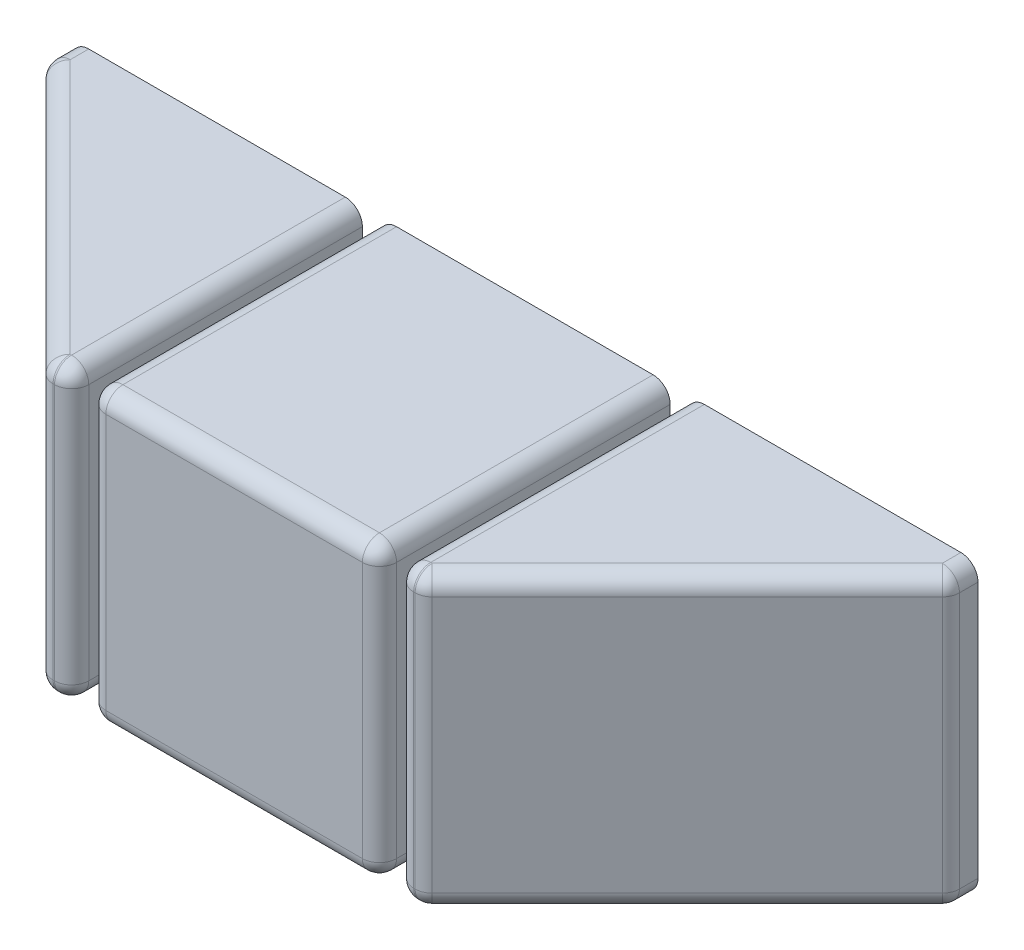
ISO-10303-21;
HEADER;
FILE_DESCRIPTION(('STEP AP214'),'2;1');
FILE_NAME('part.step','',(''),(''),'','','');
FILE_SCHEMA(('AUTOMOTIVE_DESIGN { 1 0 10303 214 1 1 1 1 }'));
ENDSEC;
DATA;
#1=APPLICATION_CONTEXT('core data for automotive mechanical design processes');
#2=APPLICATION_PROTOCOL_DEFINITION('international standard','automotive_design',2000,#1);
#3=PRODUCT_CONTEXT('',#1,'mechanical');
#4=PRODUCT('Part','Part','',(#3));
#5=PRODUCT_RELATED_PRODUCT_CATEGORY('part','',(#4));
#6=PRODUCT_DEFINITION_FORMATION('','',#4);
#7=PRODUCT_DEFINITION_CONTEXT('part definition',#1,'design');
#8=PRODUCT_DEFINITION('design','',#6,#7);
#9=PRODUCT_DEFINITION_SHAPE('','',#8);
#10=(LENGTH_UNIT() NAMED_UNIT(*) SI_UNIT(.MILLI.,.METRE.));
#11=(NAMED_UNIT(*) PLANE_ANGLE_UNIT() SI_UNIT($,.RADIAN.));
#12=(NAMED_UNIT(*) SI_UNIT($,.STERADIAN.) SOLID_ANGLE_UNIT());
#13=UNCERTAINTY_MEASURE_WITH_UNIT(LENGTH_MEASURE(1.E-05),#10,'distance_accuracy_value','');
#14=(GEOMETRIC_REPRESENTATION_CONTEXT(3) GLOBAL_UNCERTAINTY_ASSIGNED_CONTEXT((#13)) GLOBAL_UNIT_ASSIGNED_CONTEXT((#10,
#11,#12)) REPRESENTATION_CONTEXT('',''));
#15=CARTESIAN_POINT('',(0.,0.,0.));
#16=DIRECTION('',(0.,0.,1.));
#17=DIRECTION('',(1.,0.,0.));
#18=AXIS2_PLACEMENT_3D('',#15,#16,#17);
#19=CARTESIAN_POINT('',(255.,-75.,170.));
#20=DIRECTION('',(0.,0.,-1.));
#21=DIRECTION('',(-1.,0.,0.));
#22=AXIS2_PLACEMENT_3D('',#19,#20,#21);
#23=CYLINDRICAL_SURFACE('',#22,10.);
#24=DIRECTION('',(0.,0.,-1.));
#25=VECTOR('',#24,1.);
#26=CARTESIAN_POINT('',(265.,-75.,170.));
#27=LINE('',#26,#25);
#28=CARTESIAN_POINT('',(265.,-75.,10.857864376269));
#29=VERTEX_POINT('',#28);
#30=CARTESIAN_POINT('',(265.,-75.,0.));
#31=VERTEX_POINT('',#30);
#32=EDGE_CURVE('E253',#29,#31,#27,.T.);
#33=ORIENTED_EDGE('',*,*,#32,.F.);
#34=CARTESIAN_POINT('',(255.,-75.,10.857864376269));
#35=DIRECTION('',(0.,0.,-1.));
#36=DIRECTION('',(-1.,0.,0.));
#37=AXIS2_PLACEMENT_3D('',#34,#35,#36);
#38=CIRCLE('',#37,10.);
#39=CARTESIAN_POINT('',(255.,-85.,10.857864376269));
#40=VERTEX_POINT('',#39);
#41=EDGE_CURVE('E157',#29,#40,#38,.T.);
#42=ORIENTED_EDGE('',*,*,#41,.T.);
#43=DIRECTION('',(0.,0.,-1.));
#44=VECTOR('',#43,1.);
#45=CARTESIAN_POINT('',(255.,-85.,170.));
#46=LINE('',#45,#44);
#47=CARTESIAN_POINT('',(255.,-85.,0.));
#48=VERTEX_POINT('',#47);
#49=EDGE_CURVE('E151',#40,#48,#46,.T.);
#50=ORIENTED_EDGE('',*,*,#49,.T.);
#51=CARTESIAN_POINT('',(255.,-75.,0.));
#52=DIRECTION('',(0.,0.,1.));
#53=DIRECTION('',(1.,0.,0.));
#54=AXIS2_PLACEMENT_3D('',#51,#52,#53);
#55=CIRCLE('',#54,10.);
#56=EDGE_CURVE('E155',#48,#31,#55,.T.);
#57=ORIENTED_EDGE('',*,*,#56,.T.);
#58=EDGE_LOOP('',(#33,#42,#50,#57));
#59=FACE_BOUND('',#58,.T.);
#60=ADVANCED_FACE('F54',(#59),#23,.T.);
#61=CARTESIAN_POINT('',(265.,-75.,170.));
#62=DIRECTION('',(-1.,0.,0.));
#63=DIRECTION('',(0.,-1.,0.));
#64=AXIS2_PLACEMENT_3D('',#61,#62,#63);
#65=PLANE('',#64);
#66=DIRECTION('',(0.,0.,-1.));
#67=VECTOR('',#66,1.);
#68=CARTESIAN_POINT('',(265.,75.,170.));
#69=LINE('',#68,#67);
#70=CARTESIAN_POINT('',(265.,75.,10.857864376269));
#71=VERTEX_POINT('',#70);
#72=CARTESIAN_POINT('',(265.,75.,0.));
#73=VERTEX_POINT('',#72);
#74=EDGE_CURVE('E256',#71,#73,#69,.T.);
#75=ORIENTED_EDGE('',*,*,#74,.F.);
#76=DIRECTION('',(0.,1.,0.));
#77=VECTOR('',#76,1.);
#78=CARTESIAN_POINT('',(265.,-75.0000000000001,10.857864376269));
#79=LINE('',#78,#77);
#80=EDGE_CURVE('E199',#71,#29,#79,.F.);
#81=ORIENTED_EDGE('',*,*,#80,.T.);
#82=ORIENTED_EDGE('',*,*,#32,.T.);
#83=DIRECTION('',(0.,1.,0.));
#84=VECTOR('',#83,1.);
#85=CARTESIAN_POINT('',(265.,-75.,0.));
#86=LINE('',#85,#84);
#87=EDGE_CURVE('E173',#31,#73,#86,.T.);
#88=ORIENTED_EDGE('',*,*,#87,.T.);
#89=EDGE_LOOP('',(#75,#81,#82,#88));
#90=FACE_BOUND('',#89,.T.);
#91=ADVANCED_FACE('F288',(#90),#65,.F.);
#92=CARTESIAN_POINT('',(255.,75.,170.));
#93=DIRECTION('',(0.,0.,-1.));
#94=DIRECTION('',(-1.,0.,0.));
#95=AXIS2_PLACEMENT_3D('',#92,#93,#94);
#96=CYLINDRICAL_SURFACE('',#95,10.);
#97=DIRECTION('',(0.,0.,-1.));
#98=VECTOR('',#97,1.);
#99=CARTESIAN_POINT('',(255.,85.,170.));
#100=LINE('',#99,#98);
#101=CARTESIAN_POINT('',(255.,85.,10.8578643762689));
#102=VERTEX_POINT('',#101);
#103=CARTESIAN_POINT('',(255.,85.,0.));
#104=VERTEX_POINT('',#103);
#105=EDGE_CURVE('E259',#102,#104,#100,.T.);
#106=ORIENTED_EDGE('',*,*,#105,.F.);
#107=CARTESIAN_POINT('',(255.,75.,10.8578643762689));
#108=DIRECTION('',(0.,0.,-1.));
#109=DIRECTION('',(-1.,0.,0.));
#110=AXIS2_PLACEMENT_3D('',#107,#108,#109);
#111=CIRCLE('',#110,10.);
#112=EDGE_CURVE('E197',#102,#71,#111,.T.);
#113=ORIENTED_EDGE('',*,*,#112,.T.);
#114=ORIENTED_EDGE('',*,*,#74,.T.);
#115=CARTESIAN_POINT('',(255.,75.,0.));
#116=DIRECTION('',(0.,0.,-1.));
#117=DIRECTION('',(-1.,0.,0.));
#118=AXIS2_PLACEMENT_3D('',#115,#116,#117);
#119=CIRCLE('',#118,10.);
#120=EDGE_CURVE('E177',#104,#73,#119,.T.);
#121=ORIENTED_EDGE('',*,*,#120,.F.);
#122=EDGE_LOOP('',(#106,#113,#114,#121));
#123=FACE_BOUND('',#122,.T.);
#124=ADVANCED_FACE('F283',(#123),#96,.T.);
#125=CARTESIAN_POINT('',(105.,85.,170.));
#126=DIRECTION('',(0.,1.,0.));
#127=DIRECTION('',(-1.,0.,0.));
#128=AXIS2_PLACEMENT_3D('',#125,#126,#127);
#129=PLANE('',#128);
#130=DIRECTION('',(1.,0.,0.));
#131=VECTOR('',#130,1.);
#132=CARTESIAN_POINT('',(105.,85.,160.));
#133=LINE('',#132,#131);
#134=CARTESIAN_POINT('',(105.,85.,160.));
#135=VERTEX_POINT('',#134);
#136=CARTESIAN_POINT('',(105.857864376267,85.,160.));
#137=VERTEX_POINT('',#136);
#138=EDGE_CURVE('E193',#135,#137,#133,.T.);
#139=ORIENTED_EDGE('',*,*,#138,.T.);
#140=DIRECTION('',(-0.707106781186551,0.,0.707106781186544));
#141=VECTOR('',#140,1.);
#142=CARTESIAN_POINT('',(247.928932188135,85.,17.9289321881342));
#143=LINE('',#142,#141);
#144=EDGE_CURVE('E195',#137,#102,#143,.F.);
#145=ORIENTED_EDGE('',*,*,#144,.T.);
#146=ORIENTED_EDGE('',*,*,#105,.T.);
#147=DIRECTION('',(1.,0.,0.));
#148=VECTOR('',#147,1.);
#149=CARTESIAN_POINT('',(105.,85.,0.));
#150=LINE('',#149,#148);
#151=CARTESIAN_POINT('',(105.,85.,0.));
#152=VERTEX_POINT('',#151);
#153=EDGE_CURVE('E277',#152,#104,#150,.T.);
#154=ORIENTED_EDGE('',*,*,#153,.F.);
#155=DIRECTION('',(0.,0.,-1.));
#156=VECTOR('',#155,1.);
#157=CARTESIAN_POINT('',(105.,85.,170.));
#158=LINE('',#157,#156);
#159=EDGE_CURVE('E263',#135,#152,#158,.T.);
#160=ORIENTED_EDGE('',*,*,#159,.F.);
#161=EDGE_LOOP('',(#139,#145,#146,#154,#160));
#162=FACE_BOUND('',#161,.T.);
#163=ADVANCED_FACE('F295',(#162),#129,.T.);
#164=CARTESIAN_POINT('',(105.,75.,170.));
#165=DIRECTION('',(0.,0.,-1.));
#166=DIRECTION('',(-1.,0.,0.));
#167=AXIS2_PLACEMENT_3D('',#164,#165,#166);
#168=CYLINDRICAL_SURFACE('',#167,9.99999999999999);
#169=DIRECTION('',(0.,0.,-1.));
#170=VECTOR('',#169,1.);
#171=CARTESIAN_POINT('',(95.,75.,170.));
#172=LINE('',#171,#170);
#173=CARTESIAN_POINT('',(95.,75.,160.));
#174=VERTEX_POINT('',#173);
#175=CARTESIAN_POINT('',(95.,75.,0.));
#176=VERTEX_POINT('',#175);
#177=EDGE_CURVE('E265',#174,#176,#172,.T.);
#178=ORIENTED_EDGE('',*,*,#177,.F.);
#179=CARTESIAN_POINT('',(105.,75.,160.));
#180=DIRECTION('',(0.,0.,-1.));
#181=DIRECTION('',(-1.,0.,0.));
#182=AXIS2_PLACEMENT_3D('',#179,#180,#181);
#183=CIRCLE('',#182,9.99999999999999);
#184=EDGE_CURVE('E12',#174,#135,#183,.T.);
#185=ORIENTED_EDGE('',*,*,#184,.T.);
#186=ORIENTED_EDGE('',*,*,#159,.T.);
#187=CARTESIAN_POINT('',(105.,75.,0.));
#188=DIRECTION('',(0.,0.,-1.));
#189=DIRECTION('',(-1.,0.,0.));
#190=AXIS2_PLACEMENT_3D('',#187,#188,#189);
#191=CIRCLE('',#190,9.99999999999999);
#192=EDGE_CURVE('E274',#176,#152,#191,.T.);
#193=ORIENTED_EDGE('',*,*,#192,.F.);
#194=EDGE_LOOP('',(#178,#185,#186,#193));
#195=FACE_BOUND('',#194,.T.);
#196=ADVANCED_FACE('F302',(#195),#168,.T.);
#197=CARTESIAN_POINT('',(95.,-75.,170.));
#198=DIRECTION('',(-1.,0.,0.));
#199=DIRECTION('',(0.,-1.,0.));
#200=AXIS2_PLACEMENT_3D('',#197,#198,#199);
#201=PLANE('',#200);
#202=DIRECTION('',(0.,0.,-1.));
#203=VECTOR('',#202,1.);
#204=CARTESIAN_POINT('',(95.,-75.,170.));
#205=LINE('',#204,#203);
#206=CARTESIAN_POINT('',(95.,-75.,160.));
#207=VERTEX_POINT('',#206);
#208=CARTESIAN_POINT('',(95.,-75.,0.));
#209=VERTEX_POINT('',#208);
#210=EDGE_CURVE('E267',#207,#209,#205,.T.);
#211=ORIENTED_EDGE('',*,*,#210,.F.);
#212=DIRECTION('',(0.,1.,0.));
#213=VECTOR('',#212,1.);
#214=CARTESIAN_POINT('',(95.,-75.,160.));
#215=LINE('',#214,#213);
#216=EDGE_CURVE('E63',#207,#174,#215,.T.);
#217=ORIENTED_EDGE('',*,*,#216,.T.);
#218=ORIENTED_EDGE('',*,*,#177,.T.);
#219=DIRECTION('',(0.,1.,0.));
#220=VECTOR('',#219,1.);
#221=CARTESIAN_POINT('',(95.,-75.,0.));
#222=LINE('',#221,#220);
#223=EDGE_CURVE('E271',#209,#176,#222,.T.);
#224=ORIENTED_EDGE('',*,*,#223,.F.);
#225=EDGE_LOOP('',(#211,#217,#218,#224));
#226=FACE_BOUND('',#225,.T.);
#227=ADVANCED_FACE('F306',(#226),#201,.T.);
#228=CARTESIAN_POINT('',(105.,-75.,170.));
#229=DIRECTION('',(0.,0.,-1.));
#230=DIRECTION('',(-1.,0.,0.));
#231=AXIS2_PLACEMENT_3D('',#228,#229,#230);
#232=CYLINDRICAL_SURFACE('',#231,9.99999999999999);
#233=DIRECTION('',(0.,0.,-1.));
#234=VECTOR('',#233,1.);
#235=CARTESIAN_POINT('',(105.,-85.,170.));
#236=LINE('',#235,#234);
#237=CARTESIAN_POINT('',(105.,-85.,160.));
#238=VERTEX_POINT('',#237);
#239=CARTESIAN_POINT('',(105.,-85.,0.));
#240=VERTEX_POINT('',#239);
#241=EDGE_CURVE('E160',#238,#240,#236,.T.);
#242=ORIENTED_EDGE('',*,*,#241,.F.);
#243=CARTESIAN_POINT('',(105.,-75.,160.));
#244=DIRECTION('',(0.,0.,-1.));
#245=DIRECTION('',(-1.,0.,0.));
#246=AXIS2_PLACEMENT_3D('',#243,#244,#245);
#247=CIRCLE('',#246,9.99999999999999);
#248=EDGE_CURVE('E78',#238,#207,#247,.T.);
#249=ORIENTED_EDGE('',*,*,#248,.T.);
#250=ORIENTED_EDGE('',*,*,#210,.T.);
#251=CARTESIAN_POINT('',(105.,-75.,0.));
#252=DIRECTION('',(0.,0.,-1.));
#253=DIRECTION('',(-1.,0.,0.));
#254=AXIS2_PLACEMENT_3D('',#251,#252,#253);
#255=CIRCLE('',#254,9.99999999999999);
#256=EDGE_CURVE('E167',#240,#209,#255,.T.);
#257=ORIENTED_EDGE('',*,*,#256,.F.);
#258=EDGE_LOOP('',(#242,#249,#250,#257));
#259=FACE_BOUND('',#258,.T.);
#260=ADVANCED_FACE('F310',(#259),#232,.T.);
#261=CARTESIAN_POINT('',(105.,-85.,170.));
#262=DIRECTION('',(0.,1.,0.));
#263=DIRECTION('',(-1.,0.,0.));
#264=AXIS2_PLACEMENT_3D('',#261,#262,#263);
#265=PLANE('',#264);
#266=ORIENTED_EDGE('',*,*,#49,.F.);
#267=DIRECTION('',(-0.707106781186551,0.,0.707106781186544));
#268=VECTOR('',#267,1.);
#269=CARTESIAN_POINT('',(100.428932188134,-85.,165.428932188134));
#270=LINE('',#269,#268);
#271=CARTESIAN_POINT('',(105.857864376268,-85.,160.));
#272=VERTEX_POINT('',#271);
#273=EDGE_CURVE('E182',#40,#272,#270,.T.);
#274=ORIENTED_EDGE('',*,*,#273,.T.);
#275=DIRECTION('',(1.,0.,0.));
#276=VECTOR('',#275,1.);
#277=CARTESIAN_POINT('',(105.,-85.,160.));
#278=LINE('',#277,#276);
#279=EDGE_CURVE('E175',#272,#238,#278,.F.);
#280=ORIENTED_EDGE('',*,*,#279,.T.);
#281=ORIENTED_EDGE('',*,*,#241,.T.);
#282=DIRECTION('',(1.,0.,0.));
#283=VECTOR('',#282,1.);
#284=CARTESIAN_POINT('',(105.,-85.,0.));
#285=LINE('',#284,#283);
#286=EDGE_CURVE('E159',#240,#48,#285,.T.);
#287=ORIENTED_EDGE('',*,*,#286,.T.);
#288=EDGE_LOOP('',(#266,#274,#280,#281,#287));
#289=FACE_BOUND('',#288,.T.);
#290=ADVANCED_FACE('F163',(#289),#265,.F.);
#291=CARTESIAN_POINT('',(255.,-75.,170.));
#292=DIRECTION('',(0.,0.,1.));
#293=DIRECTION('',(1.,0.,0.));
#294=AXIS2_PLACEMENT_3D('',#291,#292,#293);
#295=PLANE('',#294);
#296=DIRECTION('',(0.,1.,0.));
#297=VECTOR('',#296,1.);
#298=CARTESIAN_POINT('',(105.,-75.,170.));
#299=LINE('',#298,#297);
#300=CARTESIAN_POINT('',(105.,75.,170.));
#301=VERTEX_POINT('',#300);
#302=CARTESIAN_POINT('',(105.,-75.,170.));
#303=VERTEX_POINT('',#302);
#304=EDGE_CURVE('E205',#301,#303,#299,.F.);
#305=ORIENTED_EDGE('',*,*,#304,.T.);
#306=DIRECTION('',(1.,0.,0.));
#307=VECTOR('',#306,1.);
#308=CARTESIAN_POINT('',(109.999999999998,-75.,170.));
#309=LINE('',#308,#307);
#310=CARTESIAN_POINT('',(105.857864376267,-75.,170.));
#311=VERTEX_POINT('',#310);
#312=EDGE_CURVE('E207',#303,#311,#309,.T.);
#313=ORIENTED_EDGE('',*,*,#312,.T.);
#314=DIRECTION('',(0.,1.,0.));
#315=VECTOR('',#314,1.);
#316=CARTESIAN_POINT('',(105.857864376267,85.,170.));
#317=LINE('',#316,#315);
#318=CARTESIAN_POINT('',(105.857864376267,75.,170.));
#319=VERTEX_POINT('',#318);
#320=EDGE_CURVE('E201',#311,#319,#317,.T.);
#321=ORIENTED_EDGE('',*,*,#320,.T.);
#322=DIRECTION('',(1.,0.,0.));
#323=VECTOR('',#322,1.);
#324=CARTESIAN_POINT('',(255.,75.,170.));
#325=LINE('',#324,#323);
#326=EDGE_CURVE('E203',#319,#301,#325,.F.);
#327=ORIENTED_EDGE('',*,*,#326,.T.);
#328=EDGE_LOOP('',(#305,#313,#321,#327));
#329=FACE_BOUND('',#328,.T.);
#330=ADVANCED_FACE('F315',(#329),#295,.T.);
#331=CARTESIAN_POINT('',(255.,-75.,0.));
#332=DIRECTION('',(0.,0.,1.));
#333=DIRECTION('',(1.,0.,0.));
#334=AXIS2_PLACEMENT_3D('',#331,#332,#333);
#335=PLANE('',#334);
#336=ORIENTED_EDGE('',*,*,#56,.F.);
#337=ORIENTED_EDGE('',*,*,#286,.F.);
#338=ORIENTED_EDGE('',*,*,#256,.T.);
#339=ORIENTED_EDGE('',*,*,#223,.T.);
#340=ORIENTED_EDGE('',*,*,#192,.T.);
#341=ORIENTED_EDGE('',*,*,#153,.T.);
#342=ORIENTED_EDGE('',*,*,#120,.T.);
#343=ORIENTED_EDGE('',*,*,#87,.F.);
#344=EDGE_LOOP('',(#336,#337,#338,#339,#340,#341,#342,#343));
#345=FACE_BOUND('',#344,.T.);
#346=ADVANCED_FACE('F170',(#345),#335,.F.);
#347=CARTESIAN_POINT('',(109.999999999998,-85.0000000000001,170.));
#348=DIRECTION('',(-0.707106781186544,0.,-0.707106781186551));
#349=DIRECTION('',(-0.707106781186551,0.,0.707106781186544));
#350=AXIS2_PLACEMENT_3D('',#347,#348,#349);
#351=PLANE('',#350);
#352=DIRECTION('',(-0.707106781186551,0.,0.707106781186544));
#353=VECTOR('',#352,1.);
#354=CARTESIAN_POINT('',(109.999999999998,-75.,170.));
#355=LINE('',#354,#353);
#356=CARTESIAN_POINT('',(112.928932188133,-75.,167.071067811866));
#357=VERTEX_POINT('',#356);
#358=CARTESIAN_POINT('',(262.071067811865,-75.,17.9289321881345));
#359=VERTEX_POINT('',#358);
#360=EDGE_CURVE('E188',#357,#359,#355,.F.);
#361=ORIENTED_EDGE('',*,*,#360,.T.);
#362=DIRECTION('',(0.,1.,0.));
#363=VECTOR('',#362,1.);
#364=CARTESIAN_POINT('',(262.071067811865,-85.0000000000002,17.9289321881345));
#365=LINE('',#364,#363);
#366=CARTESIAN_POINT('',(262.071067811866,75.,17.9289321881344));
#367=VERTEX_POINT('',#366);
#368=EDGE_CURVE('E191',#359,#367,#365,.T.);
#369=ORIENTED_EDGE('',*,*,#368,.T.);
#370=DIRECTION('',(-0.707106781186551,0.,0.707106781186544));
#371=VECTOR('',#370,1.);
#372=CARTESIAN_POINT('',(109.999999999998,75.,170.));
#373=LINE('',#372,#371);
#374=CARTESIAN_POINT('',(112.928932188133,75.,167.071067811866));
#375=VERTEX_POINT('',#374);
#376=EDGE_CURVE('E186',#367,#375,#373,.T.);
#377=ORIENTED_EDGE('',*,*,#376,.T.);
#378=DIRECTION('',(0.,1.,0.));
#379=VECTOR('',#378,1.);
#380=CARTESIAN_POINT('',(112.928932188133,-85.0000000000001,167.071067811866));
#381=LINE('',#380,#379);
#382=EDGE_CURVE('E184',#375,#357,#381,.F.);
#383=ORIENTED_EDGE('',*,*,#382,.T.);
#384=EDGE_LOOP('',(#361,#369,#377,#383));
#385=FACE_BOUND('',#384,.T.);
#386=ADVANCED_FACE('F318',(#385),#351,.F.);
#387=CARTESIAN_POINT('',(105.,75.,160.));
#388=DIRECTION('',(0.,0.,1.));
#389=DIRECTION('',(1.,0.,0.));
#390=AXIS2_PLACEMENT_3D('',#387,#388,#389);
#391=SPHERICAL_SURFACE('',#390,10.);
#392=CARTESIAN_POINT('',(105.,75.,160.));
#393=DIRECTION('',(1.,0.,0.));
#394=DIRECTION('',(0.,0.,-1.));
#395=AXIS2_PLACEMENT_3D('',#392,#393,#394);
#396=CIRCLE('',#395,10.);
#397=EDGE_CURVE('E245',#135,#301,#396,.T.);
#398=ORIENTED_EDGE('',*,*,#397,.F.);
#399=ORIENTED_EDGE('',*,*,#184,.F.);
#400=CARTESIAN_POINT('',(105.,75.,160.));
#401=DIRECTION('',(0.,-1.,0.));
#402=DIRECTION('',(0.,0.,-1.));
#403=AXIS2_PLACEMENT_3D('',#400,#401,#402);
#404=CIRCLE('',#403,10.);
#405=EDGE_CURVE('E58',#301,#174,#404,.T.);
#406=ORIENTED_EDGE('',*,*,#405,.F.);
#407=EDGE_LOOP('',(#398,#399,#406));
#408=FACE_BOUND('',#407,.T.);
#409=ADVANCED_FACE('F56',(#408),#391,.T.);
#410=CARTESIAN_POINT('',(105.,-75.,160.));
#411=DIRECTION('',(0.,1.,0.));
#412=DIRECTION('',(-1.,0.,0.));
#413=AXIS2_PLACEMENT_3D('',#410,#411,#412);
#414=CYLINDRICAL_SURFACE('',#413,10.);
#415=ORIENTED_EDGE('',*,*,#405,.T.);
#416=ORIENTED_EDGE('',*,*,#216,.F.);
#417=CARTESIAN_POINT('',(105.,-75.,160.));
#418=DIRECTION('',(0.,-1.,0.));
#419=DIRECTION('',(0.,0.,-1.));
#420=AXIS2_PLACEMENT_3D('',#417,#418,#419);
#421=CIRCLE('',#420,10.);
#422=EDGE_CURVE('E243',#303,#207,#421,.T.);
#423=ORIENTED_EDGE('',*,*,#422,.F.);
#424=ORIENTED_EDGE('',*,*,#304,.F.);
#425=EDGE_LOOP('',(#415,#416,#423,#424));
#426=FACE_BOUND('',#425,.T.);
#427=ADVANCED_FACE('F364',(#426),#414,.T.);
#428=CARTESIAN_POINT('',(105.,75.,160.));
#429=DIRECTION('',(1.,0.,0.));
#430=DIRECTION('',(0.,1.,0.));
#431=AXIS2_PLACEMENT_3D('',#428,#429,#430);
#432=CYLINDRICAL_SURFACE('',#431,10.);
#433=ORIENTED_EDGE('',*,*,#397,.T.);
#434=ORIENTED_EDGE('',*,*,#326,.F.);
#435=CARTESIAN_POINT('',(105.857864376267,75.,160.));
#436=DIRECTION('',(1.,0.,0.));
#437=DIRECTION('',(0.,0.,-1.));
#438=AXIS2_PLACEMENT_3D('',#435,#436,#437);
#439=CIRCLE('',#438,10.);
#440=EDGE_CURVE('E240',#137,#319,#439,.T.);
#441=ORIENTED_EDGE('',*,*,#440,.F.);
#442=ORIENTED_EDGE('',*,*,#138,.F.);
#443=EDGE_LOOP('',(#433,#434,#441,#442));
#444=FACE_BOUND('',#443,.T.);
#445=ADVANCED_FACE('F361',(#444),#432,.T.);
#446=CARTESIAN_POINT('',(105.,-75.,160.));
#447=DIRECTION('',(0.,0.,1.));
#448=DIRECTION('',(1.,0.,0.));
#449=AXIS2_PLACEMENT_3D('',#446,#447,#448);
#450=SPHERICAL_SURFACE('',#449,10.);
#451=ORIENTED_EDGE('',*,*,#422,.T.);
#452=ORIENTED_EDGE('',*,*,#248,.F.);
#453=CARTESIAN_POINT('',(105.,-75.,160.));
#454=DIRECTION('',(1.,0.,0.));
#455=DIRECTION('',(0.,1.,0.));
#456=AXIS2_PLACEMENT_3D('',#453,#454,#455);
#457=CIRCLE('',#456,10.);
#458=EDGE_CURVE('E234',#303,#238,#457,.T.);
#459=ORIENTED_EDGE('',*,*,#458,.F.);
#460=EDGE_LOOP('',(#451,#452,#459));
#461=FACE_BOUND('',#460,.T.);
#462=ADVANCED_FACE('F357',(#461),#450,.T.);
#463=CARTESIAN_POINT('',(105.857864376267,75.,160.));
#464=DIRECTION('',(0.,1.,0.));
#465=DIRECTION('',(-1.,0.,0.));
#466=AXIS2_PLACEMENT_3D('',#463,#464,#465);
#467=SPHERICAL_SURFACE('',#466,10.);
#468=CARTESIAN_POINT('',(105.857864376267,75.,160.));
#469=DIRECTION('',(0.,1.,0.));
#470=DIRECTION('',(0.,0.,1.));
#471=AXIS2_PLACEMENT_3D('',#468,#469,#470);
#472=CIRCLE('',#471,10.);
#473=EDGE_CURVE('E231',#375,#319,#472,.F.);
#474=ORIENTED_EDGE('',*,*,#473,.F.);
#475=CARTESIAN_POINT('',(105.857864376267,75.,160.));
#476=DIRECTION('',(-0.707106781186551,0.,0.707106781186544));
#477=DIRECTION('',(0.707106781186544,0.,0.707106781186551));
#478=AXIS2_PLACEMENT_3D('',#475,#476,#477);
#479=CIRCLE('',#478,10.);
#480=EDGE_CURVE('E237',#137,#375,#479,.F.);
#481=ORIENTED_EDGE('',*,*,#480,.F.);
#482=ORIENTED_EDGE('',*,*,#440,.T.);
#483=EDGE_LOOP('',(#474,#481,#482));
#484=FACE_BOUND('',#483,.T.);
#485=ADVANCED_FACE('F353',(#484),#467,.T.);
#486=CARTESIAN_POINT('',(102.928932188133,75.,162.928932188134));
#487=DIRECTION('',(0.707106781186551,0.,-0.707106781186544));
#488=DIRECTION('',(-0.707106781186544,0.,-0.707106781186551));
#489=AXIS2_PLACEMENT_3D('',#486,#487,#488);
#490=CYLINDRICAL_SURFACE('',#489,10.);
#491=ORIENTED_EDGE('',*,*,#480,.T.);
#492=ORIENTED_EDGE('',*,*,#376,.F.);
#493=CARTESIAN_POINT('',(255.,75.,10.8578643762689));
#494=DIRECTION('',(0.707106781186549,0.,-0.707106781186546));
#495=DIRECTION('',(-0.707106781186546,0.,-0.707106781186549));
#496=AXIS2_PLACEMENT_3D('',#493,#494,#495);
#497=CIRCLE('',#496,10.);
#498=EDGE_CURVE('E228',#102,#367,#497,.T.);
#499=ORIENTED_EDGE('',*,*,#498,.F.);
#500=ORIENTED_EDGE('',*,*,#144,.F.);
#501=EDGE_LOOP('',(#491,#492,#499,#500));
#502=FACE_BOUND('',#501,.T.);
#503=ADVANCED_FACE('F349',(#502),#490,.T.);
#504=CARTESIAN_POINT('',(255.,-75.,160.));
#505=DIRECTION('',(-1.,0.,0.));
#506=DIRECTION('',(0.,-1.,0.));
#507=AXIS2_PLACEMENT_3D('',#504,#505,#506);
#508=CYLINDRICAL_SURFACE('',#507,10.);
#509=ORIENTED_EDGE('',*,*,#458,.T.);
#510=ORIENTED_EDGE('',*,*,#279,.F.);
#511=CARTESIAN_POINT('',(105.857864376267,-75.,160.));
#512=DIRECTION('',(1.,0.,0.));
#513=DIRECTION('',(0.,1.,0.));
#514=AXIS2_PLACEMENT_3D('',#511,#512,#513);
#515=CIRCLE('',#514,10.);
#516=EDGE_CURVE('E225',#311,#272,#515,.T.);
#517=ORIENTED_EDGE('',*,*,#516,.F.);
#518=ORIENTED_EDGE('',*,*,#312,.F.);
#519=EDGE_LOOP('',(#509,#510,#517,#518));
#520=FACE_BOUND('',#519,.T.);
#521=ADVANCED_FACE('F345',(#520),#508,.T.);
#522=CARTESIAN_POINT('',(105.857864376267,-75.,160.));
#523=DIRECTION('',(0.,-1.,0.));
#524=DIRECTION('',(1.,0.,0.));
#525=AXIS2_PLACEMENT_3D('',#522,#523,#524);
#526=CYLINDRICAL_SURFACE('',#525,10.);
#527=ORIENTED_EDGE('',*,*,#473,.T.);
#528=ORIENTED_EDGE('',*,*,#320,.F.);
#529=CARTESIAN_POINT('',(105.857864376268,-75.,160.));
#530=DIRECTION('',(0.,-1.,0.));
#531=DIRECTION('',(0.,0.,-1.));
#532=AXIS2_PLACEMENT_3D('',#529,#530,#531);
#533=CIRCLE('',#532,10.);
#534=EDGE_CURVE('E223',#357,#311,#533,.T.);
#535=ORIENTED_EDGE('',*,*,#534,.F.);
#536=ORIENTED_EDGE('',*,*,#382,.F.);
#537=EDGE_LOOP('',(#527,#528,#535,#536));
#538=FACE_BOUND('',#537,.T.);
#539=ADVANCED_FACE('F341',(#538),#526,.T.);
#540=CARTESIAN_POINT('',(255.,75.,10.8578643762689));
#541=DIRECTION('',(-0.707106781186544,0.,-0.707106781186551));
#542=DIRECTION('',(-0.707106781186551,0.,0.707106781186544));
#543=AXIS2_PLACEMENT_3D('',#540,#541,#542);
#544=SPHERICAL_SURFACE('',#543,10.);
#545=ORIENTED_EDGE('',*,*,#112,.F.);
#546=ORIENTED_EDGE('',*,*,#498,.T.);
#547=CARTESIAN_POINT('',(255.,75.,10.8578643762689));
#548=DIRECTION('',(0.,-1.,0.));
#549=DIRECTION('',(0.,0.,-1.));
#550=AXIS2_PLACEMENT_3D('',#547,#548,#549);
#551=CIRCLE('',#550,10.);
#552=EDGE_CURVE('E220',#71,#367,#551,.T.);
#553=ORIENTED_EDGE('',*,*,#552,.F.);
#554=EDGE_LOOP('',(#545,#546,#553));
#555=FACE_BOUND('',#554,.T.);
#556=ADVANCED_FACE('F337',(#555),#544,.T.);
#557=CARTESIAN_POINT('',(105.857864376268,-75.,160.));
#558=DIRECTION('',(0.,-1.,0.));
#559=DIRECTION('',(0.,0.,-1.));
#560=AXIS2_PLACEMENT_3D('',#557,#558,#559);
#561=SPHERICAL_SURFACE('',#560,10.);
#562=ORIENTED_EDGE('',*,*,#534,.T.);
#563=ORIENTED_EDGE('',*,*,#516,.T.);
#564=CARTESIAN_POINT('',(105.857864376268,-75.,160.));
#565=DIRECTION('',(-0.707106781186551,0.,0.707106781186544));
#566=DIRECTION('',(0.707106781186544,0.,0.707106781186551));
#567=AXIS2_PLACEMENT_3D('',#564,#565,#566);
#568=CIRCLE('',#567,10.);
#569=EDGE_CURVE('E217',#357,#272,#568,.F.);
#570=ORIENTED_EDGE('',*,*,#569,.F.);
#571=EDGE_LOOP('',(#562,#563,#570));
#572=FACE_BOUND('',#571,.T.);
#573=ADVANCED_FACE('F333',(#572),#561,.T.);
#574=CARTESIAN_POINT('',(255.,-85.0000000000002,10.857864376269));
#575=DIRECTION('',(0.,1.,0.));
#576=DIRECTION('',(0.,0.,1.));
#577=AXIS2_PLACEMENT_3D('',#574,#575,#576);
#578=CYLINDRICAL_SURFACE('',#577,10.);
#579=ORIENTED_EDGE('',*,*,#552,.T.);
#580=ORIENTED_EDGE('',*,*,#368,.F.);
#581=CARTESIAN_POINT('',(255.,-75.,10.857864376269));
#582=DIRECTION('',(0.,-1.,0.));
#583=DIRECTION('',(0.,0.,-1.));
#584=AXIS2_PLACEMENT_3D('',#581,#582,#583);
#585=CIRCLE('',#584,10.);
#586=EDGE_CURVE('E214',#29,#359,#585,.T.);
#587=ORIENTED_EDGE('',*,*,#586,.F.);
#588=ORIENTED_EDGE('',*,*,#80,.F.);
#589=EDGE_LOOP('',(#579,#580,#587,#588));
#590=FACE_BOUND('',#589,.T.);
#591=ADVANCED_FACE('F329',(#590),#578,.T.);
#592=CARTESIAN_POINT('',(100.428932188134,-75.,165.428932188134));
#593=DIRECTION('',(-0.707106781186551,0.,0.707106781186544));
#594=DIRECTION('',(0.707106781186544,0.,0.707106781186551));
#595=AXIS2_PLACEMENT_3D('',#592,#593,#594);
#596=CYLINDRICAL_SURFACE('',#595,10.);
#597=ORIENTED_EDGE('',*,*,#569,.T.);
#598=ORIENTED_EDGE('',*,*,#273,.F.);
#599=CARTESIAN_POINT('',(255.,-75.,10.857864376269));
#600=DIRECTION('',(0.707106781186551,0.,-0.707106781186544));
#601=DIRECTION('',(-0.707106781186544,0.,-0.707106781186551));
#602=AXIS2_PLACEMENT_3D('',#599,#600,#601);
#603=CIRCLE('',#602,10.);
#604=EDGE_CURVE('E212',#359,#40,#603,.T.);
#605=ORIENTED_EDGE('',*,*,#604,.F.);
#606=ORIENTED_EDGE('',*,*,#360,.F.);
#607=EDGE_LOOP('',(#597,#598,#605,#606));
#608=FACE_BOUND('',#607,.T.);
#609=ADVANCED_FACE('F325',(#608),#596,.T.);
#610=CARTESIAN_POINT('',(255.,-75.,10.857864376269));
#611=DIRECTION('',(-0.707106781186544,0.,-0.707106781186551));
#612=DIRECTION('',(-0.707106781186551,0.,0.707106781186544));
#613=AXIS2_PLACEMENT_3D('',#610,#611,#612);
#614=SPHERICAL_SURFACE('',#613,10.);
#615=ORIENTED_EDGE('',*,*,#41,.F.);
#616=ORIENTED_EDGE('',*,*,#586,.T.);
#617=ORIENTED_EDGE('',*,*,#604,.T.);
#618=EDGE_LOOP('',(#615,#616,#617));
#619=FACE_BOUND('',#618,.T.);
#620=ADVANCED_FACE('F322',(#619),#614,.T.);
#621=CLOSED_SHELL('',(#60,#91,#124,#163,#196,#227,#260,#290,#330,#346,#386,#409,#427,#445,#462,
#485,#503,#521,#539,#556,#573,#591,#609,#620));
#622=MANIFOLD_SOLID_BREP('B2',#621);
#623=CARTESIAN_POINT('',(85.,-75.,170.));
#624=DIRECTION('',(-1.,0.,0.));
#625=DIRECTION('',(0.,-1.,0.));
#626=AXIS2_PLACEMENT_3D('',#623,#624,#625);
#627=PLANE('',#626);
#628=DIRECTION('',(0.,0.,-1.));
#629=VECTOR('',#628,1.);
#630=CARTESIAN_POINT('',(85.,75.,170.));
#631=LINE('',#630,#629);
#632=CARTESIAN_POINT('',(85.,75.,160.));
#633=VERTEX_POINT('',#632);
#634=CARTESIAN_POINT('',(85.,75.,0.));
#635=VERTEX_POINT('',#634);
#636=EDGE_CURVE('E697',#633,#635,#631,.T.);
#637=ORIENTED_EDGE('',*,*,#636,.F.);
#638=DIRECTION('',(0.,1.,0.));
#639=VECTOR('',#638,1.);
#640=CARTESIAN_POINT('',(85.,-75.,160.));
#641=LINE('',#640,#639);
#642=CARTESIAN_POINT('',(85.0000000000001,-75.,160.));
#643=VERTEX_POINT('',#642);
#644=EDGE_CURVE('E52',#633,#643,#641,.F.);
#645=ORIENTED_EDGE('',*,*,#644,.T.);
#646=DIRECTION('',(0.,0.,-1.));
#647=VECTOR('',#646,1.);
#648=CARTESIAN_POINT('',(85.0000000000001,-75.,170.));
#649=LINE('',#648,#647);
#650=CARTESIAN_POINT('',(85.0000000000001,-75.,0.));
#651=VERTEX_POINT('',#650);
#652=EDGE_CURVE('E625',#643,#651,#649,.T.);
#653=ORIENTED_EDGE('',*,*,#652,.T.);
#654=DIRECTION('',(0.,1.,0.));
#655=VECTOR('',#654,1.);
#656=CARTESIAN_POINT('',(85.,-75.,0.));
#657=LINE('',#656,#655);
#658=EDGE_CURVE('E628',#651,#635,#657,.T.);
#659=ORIENTED_EDGE('',*,*,#658,.T.);
#660=EDGE_LOOP('',(#637,#645,#653,#659));
#661=FACE_BOUND('',#660,.T.);
#662=ADVANCED_FACE('F547',(#661),#627,.F.);
#663=CARTESIAN_POINT('',(75.,75.,170.));
#664=DIRECTION('',(0.,0.,-1.));
#665=DIRECTION('',(-1.,0.,0.));
#666=AXIS2_PLACEMENT_3D('',#663,#664,#665);
#667=CYLINDRICAL_SURFACE('',#666,10.);
#668=DIRECTION('',(0.,0.,-1.));
#669=VECTOR('',#668,1.);
#670=CARTESIAN_POINT('',(75.,85.,170.));
#671=LINE('',#670,#669);
#672=CARTESIAN_POINT('',(75.,85.,160.));
#673=VERTEX_POINT('',#672);
#674=CARTESIAN_POINT('',(75.,85.,0.));
#675=VERTEX_POINT('',#674);
#676=EDGE_CURVE('E701',#673,#675,#671,.T.);
#677=ORIENTED_EDGE('',*,*,#676,.F.);
#678=CARTESIAN_POINT('',(75.,75.,160.));
#679=DIRECTION('',(0.,0.,-1.));
#680=DIRECTION('',(-1.,0.,0.));
#681=AXIS2_PLACEMENT_3D('',#678,#679,#680);
#682=CIRCLE('',#681,10.);
#683=EDGE_CURVE('E556',#673,#633,#682,.T.);
#684=ORIENTED_EDGE('',*,*,#683,.T.);
#685=ORIENTED_EDGE('',*,*,#636,.T.);
#686=CARTESIAN_POINT('',(75.,75.,0.));
#687=DIRECTION('',(0.,0.,1.));
#688=DIRECTION('',(1.,0.,0.));
#689=AXIS2_PLACEMENT_3D('',#686,#687,#688);
#690=CIRCLE('',#689,10.);
#691=EDGE_CURVE('E648',#635,#675,#690,.T.);
#692=ORIENTED_EDGE('',*,*,#691,.T.);
#693=EDGE_LOOP('',(#677,#684,#685,#692));
#694=FACE_BOUND('',#693,.T.);
#695=ADVANCED_FACE('F772',(#694),#667,.T.);
#696=CARTESIAN_POINT('',(75.,85.,170.));
#697=DIRECTION('',(0.,-1.,0.));
#698=DIRECTION('',(1.,0.,0.));
#699=AXIS2_PLACEMENT_3D('',#696,#697,#698);
#700=PLANE('',#699);
#701=DIRECTION('',(0.,0.,-1.));
#702=VECTOR('',#701,1.);
#703=CARTESIAN_POINT('',(-75.,85.,170.));
#704=LINE('',#703,#702);
#705=CARTESIAN_POINT('',(-75.,85.,160.));
#706=VERTEX_POINT('',#705);
#707=CARTESIAN_POINT('',(-75.,85.,0.));
#708=VERTEX_POINT('',#707);
#709=EDGE_CURVE('E703',#706,#708,#704,.T.);
#710=ORIENTED_EDGE('',*,*,#709,.F.);
#711=DIRECTION('',(-1.,0.,0.));
#712=VECTOR('',#711,1.);
#713=CARTESIAN_POINT('',(75.,85.,160.));
#714=LINE('',#713,#712);
#715=EDGE_CURVE('E571',#706,#673,#714,.F.);
#716=ORIENTED_EDGE('',*,*,#715,.T.);
#717=ORIENTED_EDGE('',*,*,#676,.T.);
#718=DIRECTION('',(-1.,0.,0.));
#719=VECTOR('',#718,1.);
#720=CARTESIAN_POINT('',(75.,85.,0.));
#721=LINE('',#720,#719);
#722=EDGE_CURVE('E653',#675,#708,#721,.T.);
#723=ORIENTED_EDGE('',*,*,#722,.T.);
#724=EDGE_LOOP('',(#710,#716,#717,#723));
#725=FACE_BOUND('',#724,.T.);
#726=ADVANCED_FACE('F725',(#725),#700,.F.);
#727=CARTESIAN_POINT('',(-75.,75.,170.));
#728=DIRECTION('',(0.,0.,-1.));
#729=DIRECTION('',(-1.,0.,0.));
#730=AXIS2_PLACEMENT_3D('',#727,#728,#729);
#731=CYLINDRICAL_SURFACE('',#730,10.);
#732=DIRECTION('',(0.,0.,-1.));
#733=VECTOR('',#732,1.);
#734=CARTESIAN_POINT('',(-85.,75.,170.));
#735=LINE('',#734,#733);
#736=CARTESIAN_POINT('',(-85.,75.,160.));
#737=VERTEX_POINT('',#736);
#738=CARTESIAN_POINT('',(-85.,75.,0.));
#739=VERTEX_POINT('',#738);
#740=EDGE_CURVE('E707',#737,#739,#735,.T.);
#741=ORIENTED_EDGE('',*,*,#740,.F.);
#742=CARTESIAN_POINT('',(-75.,75.,160.));
#743=DIRECTION('',(0.,0.,-1.));
#744=DIRECTION('',(-1.,0.,0.));
#745=AXIS2_PLACEMENT_3D('',#742,#743,#744);
#746=CIRCLE('',#745,10.);
#747=EDGE_CURVE('E671',#737,#706,#746,.T.);
#748=ORIENTED_EDGE('',*,*,#747,.T.);
#749=ORIENTED_EDGE('',*,*,#709,.T.);
#750=CARTESIAN_POINT('',(-75.,75.,0.));
#751=DIRECTION('',(0.,0.,1.));
#752=DIRECTION('',(1.,0.,0.));
#753=AXIS2_PLACEMENT_3D('',#750,#751,#752);
#754=CIRCLE('',#753,10.);
#755=EDGE_CURVE('E721',#708,#739,#754,.T.);
#756=ORIENTED_EDGE('',*,*,#755,.T.);
#757=EDGE_LOOP('',(#741,#748,#749,#756));
#758=FACE_BOUND('',#757,.T.);
#759=ADVANCED_FACE('F729',(#758),#731,.T.);
#760=CARTESIAN_POINT('',(-85.,-75.,170.));
#761=DIRECTION('',(-1.,0.,0.));
#762=DIRECTION('',(0.,0.,1.));
#763=AXIS2_PLACEMENT_3D('',#760,#761,#762);
#764=PLANE('',#763);
#765=DIRECTION('',(0.,0.,-1.));
#766=VECTOR('',#765,1.);
#767=CARTESIAN_POINT('',(-85.,-75.,170.));
#768=LINE('',#767,#766);
#769=CARTESIAN_POINT('',(-85.,-75.,160.));
#770=VERTEX_POINT('',#769);
#771=CARTESIAN_POINT('',(-85.,-75.,0.));
#772=VERTEX_POINT('',#771);
#773=EDGE_CURVE('E709',#770,#772,#768,.T.);
#774=ORIENTED_EDGE('',*,*,#773,.F.);
#775=DIRECTION('',(0.,1.,0.));
#776=VECTOR('',#775,1.);
#777=CARTESIAN_POINT('',(-85.,-75.,160.));
#778=LINE('',#777,#776);
#779=EDGE_CURVE('E669',#770,#737,#778,.T.);
#780=ORIENTED_EDGE('',*,*,#779,.T.);
#781=ORIENTED_EDGE('',*,*,#740,.T.);
#782=DIRECTION('',(0.,1.,0.));
#783=VECTOR('',#782,1.);
#784=CARTESIAN_POINT('',(-85.,-75.,0.));
#785=LINE('',#784,#783);
#786=EDGE_CURVE('E718',#772,#739,#785,.T.);
#787=ORIENTED_EDGE('',*,*,#786,.F.);
#788=EDGE_LOOP('',(#774,#780,#781,#787));
#789=FACE_BOUND('',#788,.T.);
#790=ADVANCED_FACE('F758',(#789),#764,.T.);
#791=CARTESIAN_POINT('',(-75.,-75.,170.));
#792=DIRECTION('',(0.,0.,-1.));
#793=DIRECTION('',(-1.,0.,0.));
#794=AXIS2_PLACEMENT_3D('',#791,#792,#793);
#795=CYLINDRICAL_SURFACE('',#794,9.99999999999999);
#796=DIRECTION('',(0.,0.,-1.));
#797=VECTOR('',#796,1.);
#798=CARTESIAN_POINT('',(-75.,-85.,170.));
#799=LINE('',#798,#797);
#800=CARTESIAN_POINT('',(-75.,-85.,160.));
#801=VERTEX_POINT('',#800);
#802=CARTESIAN_POINT('',(-75.,-85.,0.));
#803=VERTEX_POINT('',#802);
#804=EDGE_CURVE('E711',#801,#803,#799,.T.);
#805=ORIENTED_EDGE('',*,*,#804,.F.);
#806=CARTESIAN_POINT('',(-75.,-75.,160.));
#807=DIRECTION('',(0.,0.,-1.));
#808=DIRECTION('',(-1.,0.,0.));
#809=AXIS2_PLACEMENT_3D('',#806,#807,#808);
#810=CIRCLE('',#809,9.99999999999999);
#811=EDGE_CURVE('E667',#801,#770,#810,.T.);
#812=ORIENTED_EDGE('',*,*,#811,.T.);
#813=ORIENTED_EDGE('',*,*,#773,.T.);
#814=CARTESIAN_POINT('',(-75.,-75.,0.));
#815=DIRECTION('',(0.,0.,-1.));
#816=DIRECTION('',(-1.,0.,0.));
#817=AXIS2_PLACEMENT_3D('',#814,#815,#816);
#818=CIRCLE('',#817,9.99999999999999);
#819=EDGE_CURVE('E715',#803,#772,#818,.T.);
#820=ORIENTED_EDGE('',*,*,#819,.F.);
#821=EDGE_LOOP('',(#805,#812,#813,#820));
#822=FACE_BOUND('',#821,.T.);
#823=ADVANCED_FACE('F754',(#822),#795,.T.);
#824=CARTESIAN_POINT('',(75.0000000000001,-85.,170.));
#825=DIRECTION('',(0.,-1.,0.));
#826=DIRECTION('',(1.,0.,0.));
#827=AXIS2_PLACEMENT_3D('',#824,#825,#826);
#828=PLANE('',#827);
#829=DIRECTION('',(0.,0.,-1.));
#830=VECTOR('',#829,1.);
#831=CARTESIAN_POINT('',(75.0000000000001,-85.,170.));
#832=LINE('',#831,#830);
#833=CARTESIAN_POINT('',(75.0000000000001,-85.,160.));
#834=VERTEX_POINT('',#833);
#835=CARTESIAN_POINT('',(75.0000000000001,-85.,0.));
#836=VERTEX_POINT('',#835);
#837=EDGE_CURVE('E634',#834,#836,#832,.T.);
#838=ORIENTED_EDGE('',*,*,#837,.F.);
#839=DIRECTION('',(-1.,0.,0.));
#840=VECTOR('',#839,1.);
#841=CARTESIAN_POINT('',(75.0000000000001,-85.,160.));
#842=LINE('',#841,#840);
#843=EDGE_CURVE('E651',#834,#801,#842,.T.);
#844=ORIENTED_EDGE('',*,*,#843,.T.);
#845=ORIENTED_EDGE('',*,*,#804,.T.);
#846=DIRECTION('',(-1.,0.,0.));
#847=VECTOR('',#846,1.);
#848=CARTESIAN_POINT('',(75.0000000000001,-85.,0.));
#849=LINE('',#848,#847);
#850=EDGE_CURVE('E642',#836,#803,#849,.T.);
#851=ORIENTED_EDGE('',*,*,#850,.F.);
#852=EDGE_LOOP('',(#838,#844,#845,#851));
#853=FACE_BOUND('',#852,.T.);
#854=ADVANCED_FACE('F751',(#853),#828,.T.);
#855=CARTESIAN_POINT('',(75.0000000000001,-75.,170.));
#856=DIRECTION('',(0.,0.,-1.));
#857=DIRECTION('',(-1.,0.,0.));
#858=AXIS2_PLACEMENT_3D('',#855,#856,#857);
#859=CYLINDRICAL_SURFACE('',#858,9.99999999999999);
#860=ORIENTED_EDGE('',*,*,#652,.F.);
#861=CARTESIAN_POINT('',(75.0000000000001,-75.,160.));
#862=DIRECTION('',(0.,0.,-1.));
#863=DIRECTION('',(-1.,0.,0.));
#864=AXIS2_PLACEMENT_3D('',#861,#862,#863);
#865=CIRCLE('',#864,9.99999999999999);
#866=EDGE_CURVE('E649',#643,#834,#865,.T.);
#867=ORIENTED_EDGE('',*,*,#866,.T.);
#868=ORIENTED_EDGE('',*,*,#837,.T.);
#869=CARTESIAN_POINT('',(75.0000000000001,-75.,0.));
#870=DIRECTION('',(0.,0.,1.));
#871=DIRECTION('',(1.,0.,0.));
#872=AXIS2_PLACEMENT_3D('',#869,#870,#871);
#873=CIRCLE('',#872,9.99999999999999);
#874=EDGE_CURVE('E633',#836,#651,#873,.T.);
#875=ORIENTED_EDGE('',*,*,#874,.T.);
#876=EDGE_LOOP('',(#860,#867,#868,#875));
#877=FACE_BOUND('',#876,.T.);
#878=ADVANCED_FACE('F637',(#877),#859,.T.);
#879=CARTESIAN_POINT('',(75.,75.,170.));
#880=DIRECTION('',(0.,0.,1.));
#881=DIRECTION('',(1.,0.,0.));
#882=AXIS2_PLACEMENT_3D('',#879,#880,#881);
#883=PLANE('',#882);
#884=DIRECTION('',(0.,1.,0.));
#885=VECTOR('',#884,1.);
#886=CARTESIAN_POINT('',(-75.,75.,170.));
#887=LINE('',#886,#885);
#888=CARTESIAN_POINT('',(-75.,75.,170.));
#889=VERTEX_POINT('',#888);
#890=CARTESIAN_POINT('',(-75.,-75.,170.));
#891=VERTEX_POINT('',#890);
#892=EDGE_CURVE('E662',#889,#891,#887,.F.);
#893=ORIENTED_EDGE('',*,*,#892,.T.);
#894=DIRECTION('',(-1.,0.,0.));
#895=VECTOR('',#894,1.);
#896=CARTESIAN_POINT('',(75.,-75.0000000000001,170.));
#897=LINE('',#896,#895);
#898=CARTESIAN_POINT('',(75.0000000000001,-75.,170.));
#899=VERTEX_POINT('',#898);
#900=EDGE_CURVE('E664',#891,#899,#897,.F.);
#901=ORIENTED_EDGE('',*,*,#900,.T.);
#902=DIRECTION('',(0.,1.,0.));
#903=VECTOR('',#902,1.);
#904=CARTESIAN_POINT('',(75.,75.,170.));
#905=LINE('',#904,#903);
#906=CARTESIAN_POINT('',(75.,75.,170.));
#907=VERTEX_POINT('',#906);
#908=EDGE_CURVE('E658',#899,#907,#905,.T.);
#909=ORIENTED_EDGE('',*,*,#908,.T.);
#910=DIRECTION('',(-1.,0.,0.));
#911=VECTOR('',#910,1.);
#912=CARTESIAN_POINT('',(-75.,75.,170.));
#913=LINE('',#912,#911);
#914=EDGE_CURVE('E660',#907,#889,#913,.T.);
#915=ORIENTED_EDGE('',*,*,#914,.T.);
#916=EDGE_LOOP('',(#893,#901,#909,#915));
#917=FACE_BOUND('',#916,.T.);
#918=ADVANCED_FACE('F792',(#917),#883,.T.);
#919=CARTESIAN_POINT('',(75.,75.,0.));
#920=DIRECTION('',(0.,0.,1.));
#921=DIRECTION('',(1.,0.,0.));
#922=AXIS2_PLACEMENT_3D('',#919,#920,#921);
#923=PLANE('',#922);
#924=ORIENTED_EDGE('',*,*,#658,.F.);
#925=ORIENTED_EDGE('',*,*,#874,.F.);
#926=ORIENTED_EDGE('',*,*,#850,.T.);
#927=ORIENTED_EDGE('',*,*,#819,.T.);
#928=ORIENTED_EDGE('',*,*,#786,.T.);
#929=ORIENTED_EDGE('',*,*,#755,.F.);
#930=ORIENTED_EDGE('',*,*,#722,.F.);
#931=ORIENTED_EDGE('',*,*,#691,.F.);
#932=EDGE_LOOP('',(#924,#925,#926,#927,#928,#929,#930,#931));
#933=FACE_BOUND('',#932,.T.);
#934=ADVANCED_FACE('F645',(#933),#923,.F.);
#935=CARTESIAN_POINT('',(-75.,75.,160.));
#936=DIRECTION('',(0.,0.,1.));
#937=DIRECTION('',(1.,0.,0.));
#938=AXIS2_PLACEMENT_3D('',#935,#936,#937);
#939=SPHERICAL_SURFACE('',#938,10.);
#940=CARTESIAN_POINT('',(-75.,75.,160.));
#941=DIRECTION('',(1.,0.,0.));
#942=DIRECTION('',(0.,0.,-1.));
#943=AXIS2_PLACEMENT_3D('',#940,#941,#942);
#944=CIRCLE('',#943,10.);
#945=EDGE_CURVE('E690',#706,#889,#944,.T.);
#946=ORIENTED_EDGE('',*,*,#945,.F.);
#947=ORIENTED_EDGE('',*,*,#747,.F.);
#948=CARTESIAN_POINT('',(-75.,75.,160.));
#949=DIRECTION('',(0.,-1.,0.));
#950=DIRECTION('',(0.,0.,-1.));
#951=AXIS2_PLACEMENT_3D('',#948,#949,#950);
#952=CIRCLE('',#951,10.);
#953=EDGE_CURVE('E551',#889,#737,#952,.T.);
#954=ORIENTED_EDGE('',*,*,#953,.F.);
#955=EDGE_LOOP('',(#946,#947,#954));
#956=FACE_BOUND('',#955,.T.);
#957=ADVANCED_FACE('F549',(#956),#939,.T.);
#958=CARTESIAN_POINT('',(-75.,-75.,160.));
#959=DIRECTION('',(0.,1.,0.));
#960=DIRECTION('',(0.,0.,1.));
#961=AXIS2_PLACEMENT_3D('',#958,#959,#960);
#962=CYLINDRICAL_SURFACE('',#961,10.);
#963=ORIENTED_EDGE('',*,*,#953,.T.);
#964=ORIENTED_EDGE('',*,*,#779,.F.);
#965=CARTESIAN_POINT('',(-75.,-75.,160.));
#966=DIRECTION('',(0.,-1.,0.));
#967=DIRECTION('',(0.,0.,-1.));
#968=AXIS2_PLACEMENT_3D('',#965,#966,#967);
#969=CIRCLE('',#968,10.);
#970=EDGE_CURVE('E688',#891,#770,#969,.T.);
#971=ORIENTED_EDGE('',*,*,#970,.F.);
#972=ORIENTED_EDGE('',*,*,#892,.F.);
#973=EDGE_LOOP('',(#963,#964,#971,#972));
#974=FACE_BOUND('',#973,.T.);
#975=ADVANCED_FACE('F760',(#974),#962,.T.);
#976=CARTESIAN_POINT('',(75.,75.,160.));
#977=DIRECTION('',(1.,0.,0.));
#978=DIRECTION('',(0.,1.,0.));
#979=AXIS2_PLACEMENT_3D('',#976,#977,#978);
#980=CYLINDRICAL_SURFACE('',#979,10.);
#981=ORIENTED_EDGE('',*,*,#945,.T.);
#982=ORIENTED_EDGE('',*,*,#914,.F.);
#983=CARTESIAN_POINT('',(75.,75.,160.));
#984=DIRECTION('',(1.,0.,0.));
#985=DIRECTION('',(0.,0.,-1.));
#986=AXIS2_PLACEMENT_3D('',#983,#984,#985);
#987=CIRCLE('',#986,10.);
#988=EDGE_CURVE('E685',#673,#907,#987,.T.);
#989=ORIENTED_EDGE('',*,*,#988,.F.);
#990=ORIENTED_EDGE('',*,*,#715,.F.);
#991=EDGE_LOOP('',(#981,#982,#989,#990));
#992=FACE_BOUND('',#991,.T.);
#993=ADVANCED_FACE('F733',(#992),#980,.T.);
#994=CARTESIAN_POINT('',(-75.,-75.,160.));
#995=DIRECTION('',(0.,0.,1.));
#996=DIRECTION('',(1.,0.,0.));
#997=AXIS2_PLACEMENT_3D('',#994,#995,#996);
#998=SPHERICAL_SURFACE('',#997,10.);
#999=ORIENTED_EDGE('',*,*,#970,.T.);
#1000=ORIENTED_EDGE('',*,*,#811,.F.);
#1001=CARTESIAN_POINT('',(-75.,-75.,160.));
#1002=DIRECTION('',(1.,0.,0.));
#1003=DIRECTION('',(0.,0.,-1.));
#1004=AXIS2_PLACEMENT_3D('',#1001,#1002,#1003);
#1005=CIRCLE('',#1004,10.);
#1006=EDGE_CURVE('E682',#891,#801,#1005,.T.);
#1007=ORIENTED_EDGE('',*,*,#1006,.F.);
#1008=EDGE_LOOP('',(#999,#1000,#1007));
#1009=FACE_BOUND('',#1008,.T.);
#1010=ADVANCED_FACE('F762',(#1009),#998,.T.);
#1011=CARTESIAN_POINT('',(75.,75.,160.));
#1012=DIRECTION('',(0.,0.,1.));
#1013=DIRECTION('',(1.,0.,0.));
#1014=AXIS2_PLACEMENT_3D('',#1011,#1012,#1013);
#1015=SPHERICAL_SURFACE('',#1014,10.);
#1016=ORIENTED_EDGE('',*,*,#683,.F.);
#1017=ORIENTED_EDGE('',*,*,#988,.T.);
#1018=CARTESIAN_POINT('',(75.,75.,160.));
#1019=DIRECTION('',(0.,-1.,0.));
#1020=DIRECTION('',(1.,0.,0.));
#1021=AXIS2_PLACEMENT_3D('',#1018,#1019,#1020);
#1022=CIRCLE('',#1021,10.);
#1023=EDGE_CURVE('E679',#633,#907,#1022,.T.);
#1024=ORIENTED_EDGE('',*,*,#1023,.F.);
#1025=EDGE_LOOP('',(#1016,#1017,#1024));
#1026=FACE_BOUND('',#1025,.T.);
#1027=ADVANCED_FACE('F736',(#1026),#1015,.T.);
#1028=CARTESIAN_POINT('',(75.0000000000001,-75.,160.));
#1029=DIRECTION('',(-1.,0.,0.));
#1030=DIRECTION('',(0.,-1.,0.));
#1031=AXIS2_PLACEMENT_3D('',#1028,#1029,#1030);
#1032=CYLINDRICAL_SURFACE('',#1031,10.);
#1033=ORIENTED_EDGE('',*,*,#1006,.T.);
#1034=ORIENTED_EDGE('',*,*,#843,.F.);
#1035=CARTESIAN_POINT('',(75.0000000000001,-75.,160.));
#1036=DIRECTION('',(1.,0.,0.));
#1037=DIRECTION('',(0.,0.,-1.));
#1038=AXIS2_PLACEMENT_3D('',#1035,#1036,#1037);
#1039=CIRCLE('',#1038,10.);
#1040=EDGE_CURVE('E677',#899,#834,#1039,.T.);
#1041=ORIENTED_EDGE('',*,*,#1040,.F.);
#1042=ORIENTED_EDGE('',*,*,#900,.F.);
#1043=EDGE_LOOP('',(#1033,#1034,#1041,#1042));
#1044=FACE_BOUND('',#1043,.T.);
#1045=ADVANCED_FACE('F747',(#1044),#1032,.T.);
#1046=CARTESIAN_POINT('',(75.,75.,160.));
#1047=DIRECTION('',(0.,-1.,0.));
#1048=DIRECTION('',(1.,0.,0.));
#1049=AXIS2_PLACEMENT_3D('',#1046,#1047,#1048);
#1050=CYLINDRICAL_SURFACE('',#1049,10.);
#1051=ORIENTED_EDGE('',*,*,#1023,.T.);
#1052=ORIENTED_EDGE('',*,*,#908,.F.);
#1053=CARTESIAN_POINT('',(75.0000000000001,-75.,160.));
#1054=DIRECTION('',(0.,-1.,0.));
#1055=DIRECTION('',(0.,0.,-1.));
#1056=AXIS2_PLACEMENT_3D('',#1053,#1054,#1055);
#1057=CIRCLE('',#1056,10.);
#1058=EDGE_CURVE('E675',#643,#899,#1057,.T.);
#1059=ORIENTED_EDGE('',*,*,#1058,.F.);
#1060=ORIENTED_EDGE('',*,*,#644,.F.);
#1061=EDGE_LOOP('',(#1051,#1052,#1059,#1060));
#1062=FACE_BOUND('',#1061,.T.);
#1063=ADVANCED_FACE('F740',(#1062),#1050,.T.);
#1064=CARTESIAN_POINT('',(75.0000000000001,-75.,160.));
#1065=DIRECTION('',(0.,0.,1.));
#1066=DIRECTION('',(1.,0.,0.));
#1067=AXIS2_PLACEMENT_3D('',#1064,#1065,#1066);
#1068=SPHERICAL_SURFACE('',#1067,10.);
#1069=ORIENTED_EDGE('',*,*,#1040,.T.);
#1070=ORIENTED_EDGE('',*,*,#866,.F.);
#1071=ORIENTED_EDGE('',*,*,#1058,.T.);
#1072=EDGE_LOOP('',(#1069,#1070,#1071));
#1073=FACE_BOUND('',#1072,.T.);
#1074=ADVANCED_FACE('F743',(#1073),#1068,.T.);
#1075=CLOSED_SHELL('',(#662,#695,#726,#759,#790,#823,#854,#878,#918,#934,#957,#975,#993,#1010,
#1027,#1045,#1063,#1074));
#1076=MANIFOLD_SOLID_BREP('B6',#1075);
#1077=CARTESIAN_POINT('',(-105.,-85.,170.));
#1078=DIRECTION('',(0.,-1.,0.));
#1079=DIRECTION('',(1.,0.,0.));
#1080=AXIS2_PLACEMENT_3D('',#1077,#1078,#1079);
#1081=PLANE('',#1080);
#1082=DIRECTION('',(0.,0.,-1.));
#1083=VECTOR('',#1082,1.);
#1084=CARTESIAN_POINT('',(-105.,-85.,170.));
#1085=LINE('',#1084,#1083);
#1086=CARTESIAN_POINT('',(-105.,-85.,160.));
#1087=VERTEX_POINT('',#1086);
#1088=CARTESIAN_POINT('',(-105.,-85.,0.));
#1089=VERTEX_POINT('',#1088);
#1090=EDGE_CURVE('E1047',#1087,#1089,#1085,.T.);
#1091=ORIENTED_EDGE('',*,*,#1090,.F.);
#1092=DIRECTION('',(-1.,0.,0.));
#1093=VECTOR('',#1092,1.);
#1094=CARTESIAN_POINT('',(-109.999999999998,-85.,160.));
#1095=LINE('',#1094,#1093);
#1096=CARTESIAN_POINT('',(-105.857864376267,-85.,160.));
#1097=VERTEX_POINT('',#1096);
#1098=EDGE_CURVE('E1077',#1087,#1097,#1095,.T.);
#1099=ORIENTED_EDGE('',*,*,#1098,.T.);
#1100=DIRECTION('',(-0.707106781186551,0.,-0.707106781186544));
#1101=VECTOR('',#1100,1.);
#1102=CARTESIAN_POINT('',(-247.928932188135,-85.,17.9289321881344));
#1103=LINE('',#1102,#1101);
#1104=CARTESIAN_POINT('',(-255.,-85.,10.857864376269));
#1105=VERTEX_POINT('',#1104);
#1106=EDGE_CURVE('E1013',#1097,#1105,#1103,.T.);
#1107=ORIENTED_EDGE('',*,*,#1106,.T.);
#1108=DIRECTION('',(0.,0.,-1.));
#1109=VECTOR('',#1108,1.);
#1110=CARTESIAN_POINT('',(-255.,-85.,170.));
#1111=LINE('',#1110,#1109);
#1112=CARTESIAN_POINT('',(-255.,-85.,0.));
#1113=VERTEX_POINT('',#1112);
#1114=EDGE_CURVE('E1007',#1105,#1113,#1111,.T.);
#1115=ORIENTED_EDGE('',*,*,#1114,.T.);
#1116=DIRECTION('',(-1.,0.,0.));
#1117=VECTOR('',#1116,1.);
#1118=CARTESIAN_POINT('',(-105.,-85.,0.));
#1119=LINE('',#1118,#1117);
#1120=EDGE_CURVE('E1011',#1089,#1113,#1119,.T.);
#1121=ORIENTED_EDGE('',*,*,#1120,.F.);
#1122=EDGE_LOOP('',(#1091,#1099,#1107,#1115,#1121));
#1123=FACE_BOUND('',#1122,.T.);
#1124=ADVANCED_FACE('F911',(#1123),#1081,.T.);
#1125=CARTESIAN_POINT('',(-105.,-75.,170.));
#1126=DIRECTION('',(0.,0.,-1.));
#1127=DIRECTION('',(-1.,0.,0.));
#1128=AXIS2_PLACEMENT_3D('',#1125,#1126,#1127);
#1129=CYLINDRICAL_SURFACE('',#1128,9.99999999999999);
#1130=DIRECTION('',(0.,0.,-1.));
#1131=VECTOR('',#1130,1.);
#1132=CARTESIAN_POINT('',(-95.,-75.,170.));
#1133=LINE('',#1132,#1131);
#1134=CARTESIAN_POINT('',(-95.,-75.,160.));
#1135=VERTEX_POINT('',#1134);
#1136=CARTESIAN_POINT('',(-95.,-75.,0.));
#1137=VERTEX_POINT('',#1136);
#1138=EDGE_CURVE('E1050',#1135,#1137,#1133,.T.);
#1139=ORIENTED_EDGE('',*,*,#1138,.F.);
#1140=CARTESIAN_POINT('',(-105.,-75.,160.));
#1141=DIRECTION('',(0.,0.,-1.));
#1142=DIRECTION('',(-1.,0.,0.));
#1143=AXIS2_PLACEMENT_3D('',#1140,#1141,#1142);
#1144=CIRCLE('',#1143,9.99999999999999);
#1145=EDGE_CURVE('E1074',#1135,#1087,#1144,.T.);
#1146=ORIENTED_EDGE('',*,*,#1145,.T.);
#1147=ORIENTED_EDGE('',*,*,#1090,.T.);
#1148=CARTESIAN_POINT('',(-105.,-75.,0.));
#1149=DIRECTION('',(0.,0.,1.));
#1150=DIRECTION('',(1.,0.,0.));
#1151=AXIS2_PLACEMENT_3D('',#1148,#1149,#1150);
#1152=CIRCLE('',#1151,9.99999999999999);
#1153=EDGE_CURVE('E1015',#1089,#1137,#1152,.T.);
#1154=ORIENTED_EDGE('',*,*,#1153,.T.);
#1155=EDGE_LOOP('',(#1139,#1146,#1147,#1154));
#1156=FACE_BOUND('',#1155,.T.);
#1157=ADVANCED_FACE('F1180',(#1156),#1129,.T.);
#1158=CARTESIAN_POINT('',(-95.,-75.,170.));
#1159=DIRECTION('',(-1.,0.,0.));
#1160=DIRECTION('',(0.,-1.,0.));
#1161=AXIS2_PLACEMENT_3D('',#1158,#1159,#1160);
#1162=PLANE('',#1161);
#1163=DIRECTION('',(0.,0.,-1.));
#1164=VECTOR('',#1163,1.);
#1165=CARTESIAN_POINT('',(-95.,75.,170.));
#1166=LINE('',#1165,#1164);
#1167=CARTESIAN_POINT('',(-95.,75.,160.));
#1168=VERTEX_POINT('',#1167);
#1169=CARTESIAN_POINT('',(-95.,75.,0.));
#1170=VERTEX_POINT('',#1169);
#1171=EDGE_CURVE('E1052',#1168,#1170,#1166,.T.);
#1172=ORIENTED_EDGE('',*,*,#1171,.F.);
#1173=DIRECTION('',(0.,1.,0.));
#1174=VECTOR('',#1173,1.);
#1175=CARTESIAN_POINT('',(-95.,-75.,160.));
#1176=LINE('',#1175,#1174);
#1177=EDGE_CURVE('E1072',#1168,#1135,#1176,.F.);
#1178=ORIENTED_EDGE('',*,*,#1177,.T.);
#1179=ORIENTED_EDGE('',*,*,#1138,.T.);
#1180=DIRECTION('',(0.,1.,0.));
#1181=VECTOR('',#1180,1.);
#1182=CARTESIAN_POINT('',(-95.,-75.,0.));
#1183=LINE('',#1182,#1181);
#1184=EDGE_CURVE('E1043',#1137,#1170,#1183,.T.);
#1185=ORIENTED_EDGE('',*,*,#1184,.T.);
#1186=EDGE_LOOP('',(#1172,#1178,#1179,#1185));
#1187=FACE_BOUND('',#1186,.T.);
#1188=ADVANCED_FACE('F1177',(#1187),#1162,.F.);
#1189=CARTESIAN_POINT('',(-105.,75.,170.));
#1190=DIRECTION('',(0.,0.,-1.));
#1191=DIRECTION('',(-1.,0.,0.));
#1192=AXIS2_PLACEMENT_3D('',#1189,#1190,#1191);
#1193=CYLINDRICAL_SURFACE('',#1192,9.99999999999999);
#1194=DIRECTION('',(0.,0.,-1.));
#1195=VECTOR('',#1194,1.);
#1196=CARTESIAN_POINT('',(-105.,85.,170.));
#1197=LINE('',#1196,#1195);
#1198=CARTESIAN_POINT('',(-105.,85.,160.));
#1199=VERTEX_POINT('',#1198);
#1200=CARTESIAN_POINT('',(-105.,85.,0.));
#1201=VERTEX_POINT('',#1200);
#1202=EDGE_CURVE('E1054',#1199,#1201,#1197,.T.);
#1203=ORIENTED_EDGE('',*,*,#1202,.F.);
#1204=CARTESIAN_POINT('',(-105.,75.,160.));
#1205=DIRECTION('',(0.,0.,-1.));
#1206=DIRECTION('',(-1.,0.,0.));
#1207=AXIS2_PLACEMENT_3D('',#1204,#1205,#1206);
#1208=CIRCLE('',#1207,9.99999999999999);
#1209=EDGE_CURVE('E1049',#1199,#1168,#1208,.T.);
#1210=ORIENTED_EDGE('',*,*,#1209,.T.);
#1211=ORIENTED_EDGE('',*,*,#1171,.T.);
#1212=CARTESIAN_POINT('',(-105.,75.,0.));
#1213=DIRECTION('',(0.,0.,1.));
#1214=DIRECTION('',(1.,0.,0.));
#1215=AXIS2_PLACEMENT_3D('',#1212,#1213,#1214);
#1216=CIRCLE('',#1215,9.99999999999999);
#1217=EDGE_CURVE('E1040',#1170,#1201,#1216,.T.);
#1218=ORIENTED_EDGE('',*,*,#1217,.T.);
#1219=EDGE_LOOP('',(#1203,#1210,#1211,#1218));
#1220=FACE_BOUND('',#1219,.T.);
#1221=ADVANCED_FACE('F1163',(#1220),#1193,.T.);
#1222=CARTESIAN_POINT('',(-105.,85.,170.));
#1223=DIRECTION('',(0.,-1.,0.));
#1224=DIRECTION('',(1.,0.,0.));
#1225=AXIS2_PLACEMENT_3D('',#1222,#1223,#1224);
#1226=PLANE('',#1225);
#1227=DIRECTION('',(-0.707106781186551,0.,-0.707106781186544));
#1228=VECTOR('',#1227,1.);
#1229=CARTESIAN_POINT('',(-100.428932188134,85.,165.428932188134));
#1230=LINE('',#1229,#1228);
#1231=CARTESIAN_POINT('',(-255.,85.,10.857864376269));
#1232=VERTEX_POINT('',#1231);
#1233=CARTESIAN_POINT('',(-105.857864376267,85.,160.));
#1234=VERTEX_POINT('',#1233);
#1235=EDGE_CURVE('E1079',#1232,#1234,#1230,.F.);
#1236=ORIENTED_EDGE('',*,*,#1235,.T.);
#1237=DIRECTION('',(-1.,0.,0.));
#1238=VECTOR('',#1237,1.);
#1239=CARTESIAN_POINT('',(-105.,85.,160.));
#1240=LINE('',#1239,#1238);
#1241=EDGE_CURVE('E1081',#1234,#1199,#1240,.F.);
#1242=ORIENTED_EDGE('',*,*,#1241,.T.);
#1243=ORIENTED_EDGE('',*,*,#1202,.T.);
#1244=DIRECTION('',(-1.,0.,0.));
#1245=VECTOR('',#1244,1.);
#1246=CARTESIAN_POINT('',(-105.,85.,0.));
#1247=LINE('',#1246,#1245);
#1248=CARTESIAN_POINT('',(-255.,85.,0.));
#1249=VERTEX_POINT('',#1248);
#1250=EDGE_CURVE('E1037',#1201,#1249,#1247,.T.);
#1251=ORIENTED_EDGE('',*,*,#1250,.T.);
#1252=DIRECTION('',(0.,0.,-1.));
#1253=VECTOR('',#1252,1.);
#1254=CARTESIAN_POINT('',(-255.,85.,170.));
#1255=LINE('',#1254,#1253);
#1256=EDGE_CURVE('E1056',#1232,#1249,#1255,.T.);
#1257=ORIENTED_EDGE('',*,*,#1256,.F.);
#1258=EDGE_LOOP('',(#1236,#1242,#1243,#1251,#1257));
#1259=FACE_BOUND('',#1258,.T.);
#1260=ADVANCED_FACE('F1159',(#1259),#1226,.F.);
#1261=CARTESIAN_POINT('',(-255.,75.,170.));
#1262=DIRECTION('',(0.,0.,-1.));
#1263=DIRECTION('',(-1.,0.,0.));
#1264=AXIS2_PLACEMENT_3D('',#1261,#1262,#1263);
#1265=CYLINDRICAL_SURFACE('',#1264,10.);
#1266=DIRECTION('',(0.,0.,-1.));
#1267=VECTOR('',#1266,1.);
#1268=CARTESIAN_POINT('',(-265.,75.,170.));
#1269=LINE('',#1268,#1267);
#1270=CARTESIAN_POINT('',(-265.,75.,10.857864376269));
#1271=VERTEX_POINT('',#1270);
#1272=CARTESIAN_POINT('',(-265.,75.,0.));
#1273=VERTEX_POINT('',#1272);
#1274=EDGE_CURVE('E1058',#1271,#1273,#1269,.T.);
#1275=ORIENTED_EDGE('',*,*,#1274,.F.);
#1276=CARTESIAN_POINT('',(-255.,75.,10.857864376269));
#1277=DIRECTION('',(0.,0.,-1.));
#1278=DIRECTION('',(-1.,0.,0.));
#1279=AXIS2_PLACEMENT_3D('',#1276,#1277,#1278);
#1280=CIRCLE('',#1279,10.);
#1281=EDGE_CURVE('E1083',#1271,#1232,#1280,.T.);
#1282=ORIENTED_EDGE('',*,*,#1281,.T.);
#1283=ORIENTED_EDGE('',*,*,#1256,.T.);
#1284=CARTESIAN_POINT('',(-255.,75.,0.));
#1285=DIRECTION('',(0.,0.,1.));
#1286=DIRECTION('',(1.,0.,0.));
#1287=AXIS2_PLACEMENT_3D('',#1284,#1285,#1286);
#1288=CIRCLE('',#1287,10.);
#1289=EDGE_CURVE('E1034',#1249,#1273,#1288,.T.);
#1290=ORIENTED_EDGE('',*,*,#1289,.T.);
#1291=EDGE_LOOP('',(#1275,#1282,#1283,#1290));
#1292=FACE_BOUND('',#1291,.T.);
#1293=ADVANCED_FACE('F1335',(#1292),#1265,.T.);
#1294=CARTESIAN_POINT('',(-265.,-75.0000000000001,170.));
#1295=DIRECTION('',(-1.,0.,0.));
#1296=DIRECTION('',(0.,-1.,0.));
#1297=AXIS2_PLACEMENT_3D('',#1294,#1295,#1296);
#1298=PLANE('',#1297);
#1299=DIRECTION('',(0.,0.,-1.));
#1300=VECTOR('',#1299,1.);
#1301=CARTESIAN_POINT('',(-265.,-75.0000000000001,170.));
#1302=LINE('',#1301,#1300);
#1303=CARTESIAN_POINT('',(-265.,-75.0000000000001,10.857864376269));
#1304=VERTEX_POINT('',#1303);
#1305=CARTESIAN_POINT('',(-265.,-75.0000000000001,0.));
#1306=VERTEX_POINT('',#1305);
#1307=EDGE_CURVE('E1014',#1304,#1306,#1302,.T.);
#1308=ORIENTED_EDGE('',*,*,#1307,.F.);
#1309=DIRECTION('',(0.,1.,0.));
#1310=VECTOR('',#1309,1.);
#1311=CARTESIAN_POINT('',(-265.,75.,10.857864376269));
#1312=LINE('',#1311,#1310);
#1313=EDGE_CURVE('E545',#1304,#1271,#1312,.T.);
#1314=ORIENTED_EDGE('',*,*,#1313,.T.);
#1315=ORIENTED_EDGE('',*,*,#1274,.T.);
#1316=DIRECTION('',(0.,1.,0.));
#1317=VECTOR('',#1316,1.);
#1318=CARTESIAN_POINT('',(-265.,-75.0000000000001,0.));
#1319=LINE('',#1318,#1317);
#1320=EDGE_CURVE('E1023',#1306,#1273,#1319,.T.);
#1321=ORIENTED_EDGE('',*,*,#1320,.F.);
#1322=EDGE_LOOP('',(#1308,#1314,#1315,#1321));
#1323=FACE_BOUND('',#1322,.T.);
#1324=ADVANCED_FACE('F1328',(#1323),#1298,.T.);
#1325=CARTESIAN_POINT('',(-255.,-75.0000000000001,170.));
#1326=DIRECTION('',(0.,0.,-1.));
#1327=DIRECTION('',(-1.,0.,0.));
#1328=AXIS2_PLACEMENT_3D('',#1325,#1326,#1327);
#1329=CYLINDRICAL_SURFACE('',#1328,10.);
#1330=ORIENTED_EDGE('',*,*,#1114,.F.);
#1331=CARTESIAN_POINT('',(-255.,-75.0000000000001,10.857864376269));
#1332=DIRECTION('',(0.,0.,-1.));
#1333=DIRECTION('',(-1.,0.,0.));
#1334=AXIS2_PLACEMENT_3D('',#1331,#1332,#1333);
#1335=CIRCLE('',#1334,10.);
#1336=EDGE_CURVE('E920',#1105,#1304,#1335,.T.);
#1337=ORIENTED_EDGE('',*,*,#1336,.T.);
#1338=ORIENTED_EDGE('',*,*,#1307,.T.);
#1339=CARTESIAN_POINT('',(-255.,-75.0000000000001,0.));
#1340=DIRECTION('',(0.,0.,-1.));
#1341=DIRECTION('',(-1.,0.,0.));
#1342=AXIS2_PLACEMENT_3D('',#1339,#1340,#1341);
#1343=CIRCLE('',#1342,10.);
#1344=EDGE_CURVE('E1018',#1113,#1306,#1343,.T.);
#1345=ORIENTED_EDGE('',*,*,#1344,.F.);
#1346=EDGE_LOOP('',(#1330,#1337,#1338,#1345));
#1347=FACE_BOUND('',#1346,.T.);
#1348=ADVANCED_FACE('F1019',(#1347),#1329,.T.);
#1349=CARTESIAN_POINT('',(-255.,-75.0000000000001,170.));
#1350=DIRECTION('',(0.,0.,-1.));
#1351=DIRECTION('',(-1.,0.,0.));
#1352=AXIS2_PLACEMENT_3D('',#1349,#1350,#1351);
#1353=PLANE('',#1352);
#1354=DIRECTION('',(-1.,0.,0.));
#1355=VECTOR('',#1354,1.);
#1356=CARTESIAN_POINT('',(-105.,-75.,170.));
#1357=LINE('',#1356,#1355);
#1358=CARTESIAN_POINT('',(-105.857864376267,-75.,170.));
#1359=VERTEX_POINT('',#1358);
#1360=CARTESIAN_POINT('',(-105.,-75.,170.));
#1361=VERTEX_POINT('',#1360);
#1362=EDGE_CURVE('E1067',#1359,#1361,#1357,.F.);
#1363=ORIENTED_EDGE('',*,*,#1362,.T.);
#1364=DIRECTION('',(0.,1.,0.));
#1365=VECTOR('',#1364,1.);
#1366=CARTESIAN_POINT('',(-105.,-75.,170.));
#1367=LINE('',#1366,#1365);
#1368=CARTESIAN_POINT('',(-105.,75.,170.));
#1369=VERTEX_POINT('',#1368);
#1370=EDGE_CURVE('E1069',#1361,#1369,#1367,.T.);
#1371=ORIENTED_EDGE('',*,*,#1370,.T.);
#1372=DIRECTION('',(-1.,0.,0.));
#1373=VECTOR('',#1372,1.);
#1374=CARTESIAN_POINT('',(-255.,75.,170.));
#1375=LINE('',#1374,#1373);
#1376=CARTESIAN_POINT('',(-105.857864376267,75.,170.));
#1377=VERTEX_POINT('',#1376);
#1378=EDGE_CURVE('E1065',#1369,#1377,#1375,.T.);
#1379=ORIENTED_EDGE('',*,*,#1378,.T.);
#1380=DIRECTION('',(0.,1.,0.));
#1381=VECTOR('',#1380,1.);
#1382=CARTESIAN_POINT('',(-105.857864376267,-75.,170.));
#1383=LINE('',#1382,#1381);
#1384=EDGE_CURVE('E1063',#1377,#1359,#1383,.F.);
#1385=ORIENTED_EDGE('',*,*,#1384,.T.);
#1386=EDGE_LOOP('',(#1363,#1371,#1379,#1385));
#1387=FACE_BOUND('',#1386,.T.);
#1388=ADVANCED_FACE('F1312',(#1387),#1353,.F.);
#1389=CARTESIAN_POINT('',(-255.,-75.0000000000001,0.));
#1390=DIRECTION('',(0.,0.,-1.));
#1391=DIRECTION('',(-1.,0.,0.));
#1392=AXIS2_PLACEMENT_3D('',#1389,#1390,#1391);
#1393=PLANE('',#1392);
#1394=ORIENTED_EDGE('',*,*,#1120,.T.);
#1395=ORIENTED_EDGE('',*,*,#1344,.T.);
#1396=ORIENTED_EDGE('',*,*,#1320,.T.);
#1397=ORIENTED_EDGE('',*,*,#1289,.F.);
#1398=ORIENTED_EDGE('',*,*,#1250,.F.);
#1399=ORIENTED_EDGE('',*,*,#1217,.F.);
#1400=ORIENTED_EDGE('',*,*,#1184,.F.);
#1401=ORIENTED_EDGE('',*,*,#1153,.F.);
#1402=EDGE_LOOP('',(#1394,#1395,#1396,#1397,#1398,#1399,#1400,#1401));
#1403=FACE_BOUND('',#1402,.T.);
#1404=ADVANCED_FACE('F1026',(#1403),#1393,.T.);
#1405=CARTESIAN_POINT('',(-109.999999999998,-85.0000000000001,170.));
#1406=DIRECTION('',(0.707106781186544,0.,-0.707106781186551));
#1407=DIRECTION('',(-0.707106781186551,0.,-0.707106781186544));
#1408=AXIS2_PLACEMENT_3D('',#1405,#1406,#1407);
#1409=PLANE('',#1408);
#1410=DIRECTION('',(0.,1.,0.));
#1411=VECTOR('',#1410,1.);
#1412=CARTESIAN_POINT('',(-112.928932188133,-85.0000000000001,167.071067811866));
#1413=LINE('',#1412,#1411);
#1414=CARTESIAN_POINT('',(-112.928932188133,-75.,167.071067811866));
#1415=VERTEX_POINT('',#1414);
#1416=CARTESIAN_POINT('',(-112.928932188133,75.,167.071067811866));
#1417=VERTEX_POINT('',#1416);
#1418=EDGE_CURVE('E935',#1415,#1417,#1413,.T.);
#1419=ORIENTED_EDGE('',*,*,#1418,.T.);
#1420=DIRECTION('',(-0.707106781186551,0.,-0.707106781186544));
#1421=VECTOR('',#1420,1.);
#1422=CARTESIAN_POINT('',(-109.999999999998,75.,170.));
#1423=LINE('',#1422,#1421);
#1424=CARTESIAN_POINT('',(-262.071067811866,75.,17.9289321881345));
#1425=VERTEX_POINT('',#1424);
#1426=EDGE_CURVE('E1090',#1417,#1425,#1423,.T.);
#1427=ORIENTED_EDGE('',*,*,#1426,.T.);
#1428=DIRECTION('',(0.,1.,0.));
#1429=VECTOR('',#1428,1.);
#1430=CARTESIAN_POINT('',(-262.071067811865,-75.0000000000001,17.9289321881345));
#1431=LINE('',#1430,#1429);
#1432=CARTESIAN_POINT('',(-262.071067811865,-75.0000000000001,17.9289321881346));
#1433=VERTEX_POINT('',#1432);
#1434=EDGE_CURVE('E1085',#1425,#1433,#1431,.F.);
#1435=ORIENTED_EDGE('',*,*,#1434,.T.);
#1436=DIRECTION('',(-0.707106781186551,0.,-0.707106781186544));
#1437=VECTOR('',#1436,1.);
#1438=CARTESIAN_POINT('',(-109.999999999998,-75.,170.));
#1439=LINE('',#1438,#1437);
#1440=EDGE_CURVE('E1087',#1433,#1415,#1439,.F.);
#1441=ORIENTED_EDGE('',*,*,#1440,.T.);
#1442=EDGE_LOOP('',(#1419,#1427,#1435,#1441));
#1443=FACE_BOUND('',#1442,.T.);
#1444=ADVANCED_FACE('F1139',(#1443),#1409,.F.);
#1445=CARTESIAN_POINT('',(-255.,-75.0000000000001,10.857864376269));
#1446=DIRECTION('',(0.707106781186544,0.,-0.707106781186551));
#1447=DIRECTION('',(-0.707106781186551,0.,-0.707106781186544));
#1448=AXIS2_PLACEMENT_3D('',#1445,#1446,#1447);
#1449=SPHERICAL_SURFACE('',#1448,10.);
#1450=CARTESIAN_POINT('',(-255.,-75.0000000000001,10.857864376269));
#1451=DIRECTION('',(0.,1.,0.));
#1452=DIRECTION('',(0.,0.,1.));
#1453=AXIS2_PLACEMENT_3D('',#1450,#1451,#1452);
#1454=CIRCLE('',#1453,10.);
#1455=EDGE_CURVE('E1031',#1304,#1433,#1454,.T.);
#1456=ORIENTED_EDGE('',*,*,#1455,.F.);
#1457=ORIENTED_EDGE('',*,*,#1336,.F.);
#1458=CARTESIAN_POINT('',(-255.,-75.0000000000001,10.857864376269));
#1459=DIRECTION('',(0.707106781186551,0.,0.707106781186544));
#1460=DIRECTION('',(0.707106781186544,0.,-0.707106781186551));
#1461=AXIS2_PLACEMENT_3D('',#1458,#1459,#1460);
#1462=CIRCLE('',#1461,10.);
#1463=EDGE_CURVE('E915',#1433,#1105,#1462,.T.);
#1464=ORIENTED_EDGE('',*,*,#1463,.F.);
#1465=EDGE_LOOP('',(#1456,#1457,#1464));
#1466=FACE_BOUND('',#1465,.T.);
#1467=ADVANCED_FACE('F913',(#1466),#1449,.T.);
#1468=CARTESIAN_POINT('',(-100.428932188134,-75.,165.428932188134));
#1469=DIRECTION('',(0.707106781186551,0.,0.707106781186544));
#1470=DIRECTION('',(0.707106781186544,0.,-0.707106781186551));
#1471=AXIS2_PLACEMENT_3D('',#1468,#1469,#1470);
#1472=CYLINDRICAL_SURFACE('',#1471,10.);
#1473=ORIENTED_EDGE('',*,*,#1463,.T.);
#1474=ORIENTED_EDGE('',*,*,#1106,.F.);
#1475=CARTESIAN_POINT('',(-105.857864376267,-75.,160.));
#1476=DIRECTION('',(0.707106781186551,0.,0.707106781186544));
#1477=DIRECTION('',(0.707106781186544,0.,-0.707106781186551));
#1478=AXIS2_PLACEMENT_3D('',#1475,#1476,#1477);
#1479=CIRCLE('',#1478,10.);
#1480=EDGE_CURVE('E1123',#1415,#1097,#1479,.T.);
#1481=ORIENTED_EDGE('',*,*,#1480,.F.);
#1482=ORIENTED_EDGE('',*,*,#1440,.F.);
#1483=EDGE_LOOP('',(#1473,#1474,#1481,#1482));
#1484=FACE_BOUND('',#1483,.T.);
#1485=ADVANCED_FACE('F1137',(#1484),#1472,.T.);
#1486=CARTESIAN_POINT('',(-255.,-75.0000000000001,10.857864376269));
#1487=DIRECTION('',(0.,-1.,0.));
#1488=DIRECTION('',(1.,0.,0.));
#1489=AXIS2_PLACEMENT_3D('',#1486,#1487,#1488);
#1490=CYLINDRICAL_SURFACE('',#1489,10.);
#1491=ORIENTED_EDGE('',*,*,#1455,.T.);
#1492=ORIENTED_EDGE('',*,*,#1434,.F.);
#1493=CARTESIAN_POINT('',(-255.,75.,10.857864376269));
#1494=DIRECTION('',(0.,1.,0.));
#1495=DIRECTION('',(0.,0.,1.));
#1496=AXIS2_PLACEMENT_3D('',#1493,#1494,#1495);
#1497=CIRCLE('',#1496,10.);
#1498=EDGE_CURVE('E1120',#1271,#1425,#1497,.T.);
#1499=ORIENTED_EDGE('',*,*,#1498,.F.);
#1500=ORIENTED_EDGE('',*,*,#1313,.F.);
#1501=EDGE_LOOP('',(#1491,#1492,#1499,#1500));
#1502=FACE_BOUND('',#1501,.T.);
#1503=ADVANCED_FACE('F1131',(#1502),#1490,.T.);
#1504=CARTESIAN_POINT('',(-105.857864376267,-75.,160.));
#1505=DIRECTION('',(0.,-1.,0.));
#1506=DIRECTION('',(1.,0.,0.));
#1507=AXIS2_PLACEMENT_3D('',#1504,#1505,#1506);
#1508=SPHERICAL_SURFACE('',#1507,10.);
#1509=CARTESIAN_POINT('',(-105.857864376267,-75.,160.));
#1510=DIRECTION('',(0.,-1.,0.));
#1511=DIRECTION('',(0.,0.,-1.));
#1512=AXIS2_PLACEMENT_3D('',#1509,#1510,#1511);
#1513=CIRCLE('',#1512,10.);
#1514=EDGE_CURVE('E1114',#1415,#1359,#1513,.F.);
#1515=ORIENTED_EDGE('',*,*,#1514,.F.);
#1516=ORIENTED_EDGE('',*,*,#1480,.T.);
#1517=CARTESIAN_POINT('',(-105.857864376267,-75.,160.));
#1518=DIRECTION('',(-1.,0.,0.));
#1519=DIRECTION('',(0.,0.,1.));
#1520=AXIS2_PLACEMENT_3D('',#1517,#1518,#1519);
#1521=CIRCLE('',#1520,10.);
#1522=EDGE_CURVE('E1117',#1359,#1097,#1521,.F.);
#1523=ORIENTED_EDGE('',*,*,#1522,.F.);
#1524=EDGE_LOOP('',(#1515,#1516,#1523));
#1525=FACE_BOUND('',#1524,.T.);
#1526=ADVANCED_FACE('F1190',(#1525),#1508,.T.);
#1527=CARTESIAN_POINT('',(-255.,75.,10.857864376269));
#1528=DIRECTION('',(0.707106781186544,0.,-0.707106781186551));
#1529=DIRECTION('',(-0.707106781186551,0.,-0.707106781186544));
#1530=AXIS2_PLACEMENT_3D('',#1527,#1528,#1529);
#1531=SPHERICAL_SURFACE('',#1530,10.);
#1532=ORIENTED_EDGE('',*,*,#1281,.F.);
#1533=ORIENTED_EDGE('',*,*,#1498,.T.);
#1534=CARTESIAN_POINT('',(-255.,75.,10.857864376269));
#1535=DIRECTION('',(0.707106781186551,0.,0.707106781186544));
#1536=DIRECTION('',(0.707106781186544,0.,-0.707106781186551));
#1537=AXIS2_PLACEMENT_3D('',#1534,#1535,#1536);
#1538=CIRCLE('',#1537,10.);
#1539=EDGE_CURVE('E1112',#1232,#1425,#1538,.T.);
#1540=ORIENTED_EDGE('',*,*,#1539,.F.);
#1541=EDGE_LOOP('',(#1532,#1533,#1540));
#1542=FACE_BOUND('',#1541,.T.);
#1543=ADVANCED_FACE('F1192',(#1542),#1531,.T.);
#1544=CARTESIAN_POINT('',(-105.,-75.,160.));
#1545=DIRECTION('',(1.,0.,0.));
#1546=DIRECTION('',(0.,1.,0.));
#1547=AXIS2_PLACEMENT_3D('',#1544,#1545,#1546);
#1548=CYLINDRICAL_SURFACE('',#1547,10.);
#1549=ORIENTED_EDGE('',*,*,#1522,.T.);
#1550=ORIENTED_EDGE('',*,*,#1098,.F.);
#1551=CARTESIAN_POINT('',(-105.,-75.,160.));
#1552=DIRECTION('',(1.,0.,0.));
#1553=DIRECTION('',(0.,1.,0.));
#1554=AXIS2_PLACEMENT_3D('',#1551,#1552,#1553);
#1555=CIRCLE('',#1554,10.);
#1556=EDGE_CURVE('E1109',#1361,#1087,#1555,.T.);
#1557=ORIENTED_EDGE('',*,*,#1556,.F.);
#1558=ORIENTED_EDGE('',*,*,#1362,.F.);
#1559=EDGE_LOOP('',(#1549,#1550,#1557,#1558));
#1560=FACE_BOUND('',#1559,.T.);
#1561=ADVANCED_FACE('F1187',(#1560),#1548,.T.);
#1562=CARTESIAN_POINT('',(-105.857864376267,-85.0000000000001,160.));
#1563=DIRECTION('',(0.,1.,0.));
#1564=DIRECTION('',(-1.,0.,0.));
#1565=AXIS2_PLACEMENT_3D('',#1562,#1563,#1564);
#1566=CYLINDRICAL_SURFACE('',#1565,10.);
#1567=ORIENTED_EDGE('',*,*,#1514,.T.);
#1568=ORIENTED_EDGE('',*,*,#1384,.F.);
#1569=CARTESIAN_POINT('',(-105.857864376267,75.,160.));
#1570=DIRECTION('',(0.,1.,0.));
#1571=DIRECTION('',(0.,0.,1.));
#1572=AXIS2_PLACEMENT_3D('',#1569,#1570,#1571);
#1573=CIRCLE('',#1572,10.);
#1574=EDGE_CURVE('E1106',#1417,#1377,#1573,.T.);
#1575=ORIENTED_EDGE('',*,*,#1574,.F.);
#1576=ORIENTED_EDGE('',*,*,#1418,.F.);
#1577=EDGE_LOOP('',(#1567,#1568,#1575,#1576));
#1578=FACE_BOUND('',#1577,.T.);
#1579=ADVANCED_FACE('F1149',(#1578),#1566,.T.);
#1580=CARTESIAN_POINT('',(-102.928932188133,75.,162.928932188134));
#1581=DIRECTION('',(-0.707106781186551,0.,-0.707106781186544));
#1582=DIRECTION('',(-0.707106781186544,0.,0.707106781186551));
#1583=AXIS2_PLACEMENT_3D('',#1580,#1581,#1582);
#1584=CYLINDRICAL_SURFACE('',#1583,10.);
#1585=ORIENTED_EDGE('',*,*,#1539,.T.);
#1586=ORIENTED_EDGE('',*,*,#1426,.F.);
#1587=CARTESIAN_POINT('',(-105.857864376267,75.,160.));
#1588=DIRECTION('',(0.707106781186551,0.,0.707106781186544));
#1589=DIRECTION('',(0.707106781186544,0.,-0.707106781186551));
#1590=AXIS2_PLACEMENT_3D('',#1587,#1588,#1589);
#1591=CIRCLE('',#1590,10.);
#1592=EDGE_CURVE('E1103',#1234,#1417,#1591,.T.);
#1593=ORIENTED_EDGE('',*,*,#1592,.F.);
#1594=ORIENTED_EDGE('',*,*,#1235,.F.);
#1595=EDGE_LOOP('',(#1585,#1586,#1593,#1594));
#1596=FACE_BOUND('',#1595,.T.);
#1597=ADVANCED_FACE('F1143',(#1596),#1584,.T.);
#1598=CARTESIAN_POINT('',(-105.,-75.,160.));
#1599=DIRECTION('',(0.,0.,-1.));
#1600=DIRECTION('',(-1.,0.,0.));
#1601=AXIS2_PLACEMENT_3D('',#1598,#1599,#1600);
#1602=SPHERICAL_SURFACE('',#1601,10.);
#1603=ORIENTED_EDGE('',*,*,#1556,.T.);
#1604=ORIENTED_EDGE('',*,*,#1145,.F.);
#1605=CARTESIAN_POINT('',(-105.,-75.,160.));
#1606=DIRECTION('',(0.,1.,0.));
#1607=DIRECTION('',(0.,0.,1.));
#1608=AXIS2_PLACEMENT_3D('',#1605,#1606,#1607);
#1609=CIRCLE('',#1608,10.);
#1610=EDGE_CURVE('E1100',#1361,#1135,#1609,.T.);
#1611=ORIENTED_EDGE('',*,*,#1610,.F.);
#1612=EDGE_LOOP('',(#1603,#1604,#1611));
#1613=FACE_BOUND('',#1612,.T.);
#1614=ADVANCED_FACE('F1182',(#1613),#1602,.T.);
#1615=CARTESIAN_POINT('',(-105.857864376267,75.,160.));
#1616=DIRECTION('',(0.,1.,0.));
#1617=DIRECTION('',(0.,0.,1.));
#1618=AXIS2_PLACEMENT_3D('',#1615,#1616,#1617);
#1619=SPHERICAL_SURFACE('',#1618,10.);
#1620=ORIENTED_EDGE('',*,*,#1592,.T.);
#1621=ORIENTED_EDGE('',*,*,#1574,.T.);
#1622=CARTESIAN_POINT('',(-105.857864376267,75.,160.));
#1623=DIRECTION('',(-1.,0.,0.));
#1624=DIRECTION('',(0.,0.,1.));
#1625=AXIS2_PLACEMENT_3D('',#1622,#1623,#1624);
#1626=CIRCLE('',#1625,10.);
#1627=EDGE_CURVE('E1097',#1234,#1377,#1626,.F.);
#1628=ORIENTED_EDGE('',*,*,#1627,.F.);
#1629=EDGE_LOOP('',(#1620,#1621,#1628));
#1630=FACE_BOUND('',#1629,.T.);
#1631=ADVANCED_FACE('F1151',(#1630),#1619,.T.);
#1632=CARTESIAN_POINT('',(-105.,-75.,160.));
#1633=DIRECTION('',(0.,1.,0.));
#1634=DIRECTION('',(-1.,0.,0.));
#1635=AXIS2_PLACEMENT_3D('',#1632,#1633,#1634);
#1636=CYLINDRICAL_SURFACE('',#1635,10.);
#1637=ORIENTED_EDGE('',*,*,#1610,.T.);
#1638=ORIENTED_EDGE('',*,*,#1177,.F.);
#1639=CARTESIAN_POINT('',(-105.,75.,160.));
#1640=DIRECTION('',(0.,1.,0.));
#1641=DIRECTION('',(0.,0.,1.));
#1642=AXIS2_PLACEMENT_3D('',#1639,#1640,#1641);
#1643=CIRCLE('',#1642,10.);
#1644=EDGE_CURVE('E1095',#1369,#1168,#1643,.T.);
#1645=ORIENTED_EDGE('',*,*,#1644,.F.);
#1646=ORIENTED_EDGE('',*,*,#1370,.F.);
#1647=EDGE_LOOP('',(#1637,#1638,#1645,#1646));
#1648=FACE_BOUND('',#1647,.T.);
#1649=ADVANCED_FACE('F1173',(#1648),#1636,.T.);
#1650=CARTESIAN_POINT('',(-255.,75.,160.));
#1651=DIRECTION('',(-1.,0.,0.));
#1652=DIRECTION('',(0.,-1.,0.));
#1653=AXIS2_PLACEMENT_3D('',#1650,#1651,#1652);
#1654=CYLINDRICAL_SURFACE('',#1653,10.);
#1655=ORIENTED_EDGE('',*,*,#1627,.T.);
#1656=ORIENTED_EDGE('',*,*,#1378,.F.);
#1657=CARTESIAN_POINT('',(-105.,75.,160.));
#1658=DIRECTION('',(1.,0.,0.));
#1659=DIRECTION('',(0.,0.,-1.));
#1660=AXIS2_PLACEMENT_3D('',#1657,#1658,#1659);
#1661=CIRCLE('',#1660,10.);
#1662=EDGE_CURVE('E1093',#1199,#1369,#1661,.T.);
#1663=ORIENTED_EDGE('',*,*,#1662,.F.);
#1664=ORIENTED_EDGE('',*,*,#1241,.F.);
#1665=EDGE_LOOP('',(#1655,#1656,#1663,#1664));
#1666=FACE_BOUND('',#1665,.T.);
#1667=ADVANCED_FACE('F1156',(#1666),#1654,.T.);
#1668=CARTESIAN_POINT('',(-105.,75.,160.));
#1669=DIRECTION('',(0.,0.,-1.));
#1670=DIRECTION('',(-1.,0.,0.));
#1671=AXIS2_PLACEMENT_3D('',#1668,#1669,#1670);
#1672=SPHERICAL_SURFACE('',#1671,10.);
#1673=ORIENTED_EDGE('',*,*,#1644,.T.);
#1674=ORIENTED_EDGE('',*,*,#1209,.F.);
#1675=ORIENTED_EDGE('',*,*,#1662,.T.);
#1676=EDGE_LOOP('',(#1673,#1674,#1675));
#1677=FACE_BOUND('',#1676,.T.);
#1678=ADVANCED_FACE('F1168',(#1677),#1672,.T.);
#1679=CLOSED_SHELL('',(#1124,#1157,#1188,#1221,#1260,#1293,#1324,#1348,#1388,#1404,#1444,#1467,
#1485,#1503,#1526,#1543,#1561,#1579,#1597,#1614,#1631,#1649,#1667,#1678));
#1680=MANIFOLD_SOLID_BREP('B46',#1679);
#1681=ADVANCED_BREP_SHAPE_REPRESENTATION('',(#18,#622,#1076,#1680),#14);
#1682=SHAPE_DEFINITION_REPRESENTATION(#9,#1681);
ENDSEC;
END-ISO-10303-21;
